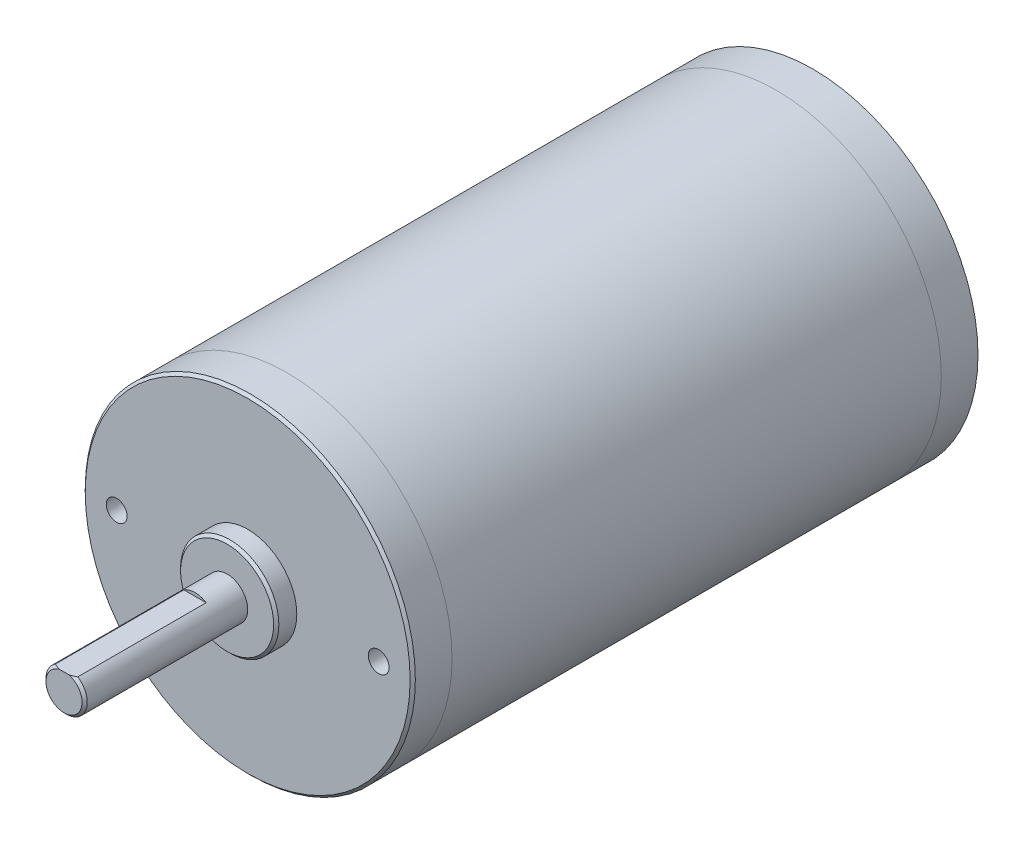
ISO-10303-21;
HEADER;
FILE_DESCRIPTION(('STEP AP214'),'2;1');
FILE_NAME('part.step','',(''),(''),'','','');
FILE_SCHEMA(('AUTOMOTIVE_DESIGN { 1 0 10303 214 1 1 1 1 }'));
ENDSEC;
DATA;
#1=APPLICATION_CONTEXT('core data for automotive mechanical design processes');
#2=APPLICATION_PROTOCOL_DEFINITION('international standard','automotive_design',2000,#1);
#3=PRODUCT_CONTEXT('',#1,'mechanical');
#4=PRODUCT('Part','Part','',(#3));
#5=PRODUCT_RELATED_PRODUCT_CATEGORY('part','',(#4));
#6=PRODUCT_DEFINITION_FORMATION('','',#4);
#7=PRODUCT_DEFINITION_CONTEXT('part definition',#1,'design');
#8=PRODUCT_DEFINITION('design','',#6,#7);
#9=PRODUCT_DEFINITION_SHAPE('','',#8);
#10=(LENGTH_UNIT() NAMED_UNIT(*) SI_UNIT(.MILLI.,.METRE.));
#11=(NAMED_UNIT(*) PLANE_ANGLE_UNIT() SI_UNIT($,.RADIAN.));
#12=(NAMED_UNIT(*) SI_UNIT($,.STERADIAN.) SOLID_ANGLE_UNIT());
#13=UNCERTAINTY_MEASURE_WITH_UNIT(LENGTH_MEASURE(1.E-05),#10,'distance_accuracy_value','');
#14=(GEOMETRIC_REPRESENTATION_CONTEXT(3) GLOBAL_UNCERTAINTY_ASSIGNED_CONTEXT((#13)) GLOBAL_UNIT_ASSIGNED_CONTEXT((#10,
#11,#12)) REPRESENTATION_CONTEXT('',''));
#15=CARTESIAN_POINT('',(0.,0.,0.));
#16=DIRECTION('',(0.,0.,1.));
#17=DIRECTION('',(1.,0.,0.));
#18=AXIS2_PLACEMENT_3D('',#15,#16,#17);
#19=CARTESIAN_POINT('',(0.,0.,141.8336));
#20=DIRECTION('',(0.,0.,-1.));
#21=DIRECTION('',(-1.,0.,0.));
#22=AXIS2_PLACEMENT_3D('',#19,#20,#21);
#23=CYLINDRICAL_SURFACE('',#22,4.0005);
#24=CARTESIAN_POINT('',(0.,0.,110.2106));
#25=DIRECTION('',(0.,0.,1.));
#26=DIRECTION('',(1.,0.,0.));
#27=AXIS2_PLACEMENT_3D('',#24,#25,#26);
#28=CIRCLE('',#27,4.0005);
#29=CARTESIAN_POINT('',(4.0005,0.,110.2106));
#30=VERTEX_POINT('',#29);
#31=EDGE_CURVE('E181',#30,#30,#28,.T.);
#32=ORIENTED_EDGE('',*,*,#31,.T.);
#33=EDGE_LOOP('',(#32));
#34=FACE_BOUND('',#33,.T.);
#35=DIRECTION('',(0.,0.,-1.));
#36=VECTOR('',#35,1.);
#37=CARTESIAN_POINT('',(2.16273206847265,3.3655,141.8336));
#38=LINE('',#37,#36);
#39=CARTESIAN_POINT('',(2.16273206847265,3.3655,141.3256));
#40=VERTEX_POINT('',#39);
#41=CARTESIAN_POINT('',(2.16273206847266,3.3655,116.4336));
#42=VERTEX_POINT('',#41);
#43=EDGE_CURVE('E167',#40,#42,#38,.T.);
#44=ORIENTED_EDGE('',*,*,#43,.F.);
#45=CARTESIAN_POINT('',(0.,0.,141.3256));
#46=DIRECTION('',(0.,0.,1.));
#47=DIRECTION('',(1.,0.,0.));
#48=AXIS2_PLACEMENT_3D('',#45,#46,#47);
#49=CIRCLE('',#48,4.0005);
#50=CARTESIAN_POINT('',(-2.16273206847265,3.3655,141.3256));
#51=VERTEX_POINT('',#50);
#52=EDGE_CURVE('E87',#40,#51,#49,.F.);
#53=ORIENTED_EDGE('',*,*,#52,.T.);
#54=DIRECTION('',(0.,0.,-1.));
#55=VECTOR('',#54,1.);
#56=CARTESIAN_POINT('',(-2.16273206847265,3.3655,141.8336));
#57=LINE('',#56,#55);
#58=CARTESIAN_POINT('',(-2.16273206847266,3.3655,116.4336));
#59=VERTEX_POINT('',#58);
#60=EDGE_CURVE('E171',#59,#51,#57,.F.);
#61=ORIENTED_EDGE('',*,*,#60,.F.);
#62=CARTESIAN_POINT('',(0.,0.,116.4336));
#63=DIRECTION('',(0.,0.,-1.));
#64=DIRECTION('',(-1.,0.,0.));
#65=AXIS2_PLACEMENT_3D('',#62,#63,#64);
#66=CIRCLE('',#65,4.0005);
#67=EDGE_CURVE('E177',#42,#59,#66,.F.);
#68=ORIENTED_EDGE('',*,*,#67,.F.);
#69=EDGE_LOOP('',(#44,#53,#61,#68));
#70=FACE_BOUND('',#69,.T.);
#71=CARTESIAN_POINT('',(-0.990599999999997,-3.87591432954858,113.3348));
#72=CARTESIAN_POINT('',(-0.990600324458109,-3.87591250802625,113.307388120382));
#73=CARTESIAN_POINT('',(-0.989461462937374,-3.8762054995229,113.27998981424));
#74=CARTESIAN_POINT('',(-0.984921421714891,-3.87736227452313,113.225397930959));
#75=CARTESIAN_POINT('',(-0.981520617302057,-3.87822596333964,113.198204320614));
#76=CARTESIAN_POINT('',(-0.967974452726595,-3.88163852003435,113.117336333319));
#77=CARTESIAN_POINT('',(-0.954485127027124,-3.88500908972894,113.064217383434));
#78=CARTESIAN_POINT('',(-0.919024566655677,-3.89354877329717,112.961088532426));
#79=CARTESIAN_POINT('',(-0.89705403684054,-3.89871773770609,112.911078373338));
#80=CARTESIAN_POINT('',(-0.845280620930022,-3.9102688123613,112.81542917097));
#81=CARTESIAN_POINT('',(-0.815475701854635,-3.91665123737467,112.769791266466));
#82=CARTESIAN_POINT('',(-0.748200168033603,-3.93006266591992,112.683226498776));
#83=CARTESIAN_POINT('',(-0.710592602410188,-3.93710177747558,112.64240766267));
#84=CARTESIAN_POINT('',(-0.629070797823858,-3.95094633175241,112.567584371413));
#85=CARTESIAN_POINT('',(-0.585155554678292,-3.95775173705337,112.533581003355));
#86=CARTESIAN_POINT('',(-0.491523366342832,-3.97047403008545,112.47291452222));
#87=CARTESIAN_POINT('',(-0.441735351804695,-3.97637750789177,112.446358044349));
#88=CARTESIAN_POINT('',(-0.338233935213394,-3.98651448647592,112.402033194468));
#89=CARTESIAN_POINT('',(-0.284521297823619,-3.99074831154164,112.384263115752));
#90=CARTESIAN_POINT('',(-0.175826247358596,-3.99699745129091,112.358361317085));
#91=CARTESIAN_POINT('',(-0.120890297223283,-3.9990551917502,112.350045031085));
#92=CARTESIAN_POINT('',(-0.010365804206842,-4.00086811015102,112.342707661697));
#93=CARTESIAN_POINT('',(0.0452226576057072,-4.00062357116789,112.343685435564));
#94=CARTESIAN_POINT('',(0.15419224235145,-3.99789104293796,112.354775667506));
#95=CARTESIAN_POINT('',(0.207595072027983,-3.99545202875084,112.364688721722));
#96=CARTESIAN_POINT('',(0.311953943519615,-3.98866156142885,112.393047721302));
#97=CARTESIAN_POINT('',(0.362909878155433,-3.98431002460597,112.411494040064));
#98=CARTESIAN_POINT('',(0.461457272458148,-3.97410816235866,112.456558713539));
#99=CARTESIAN_POINT('',(0.509014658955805,-3.96824481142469,112.483248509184));
#100=CARTESIAN_POINT('',(0.599044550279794,-3.9556561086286,112.543987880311));
#101=CARTESIAN_POINT('',(0.641516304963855,-3.94893062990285,112.578038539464));
#102=CARTESIAN_POINT('',(0.721355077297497,-3.93514089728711,112.653598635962));
#103=CARTESIAN_POINT('',(0.758557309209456,-3.9280723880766,112.695281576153));
#104=CARTESIAN_POINT('',(0.825488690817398,-3.91455467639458,112.784380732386));
#105=CARTESIAN_POINT('',(0.855215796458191,-3.9081056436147,112.831798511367));
#106=CARTESIAN_POINT('',(0.906458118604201,-3.89654079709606,112.93134765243));
#107=CARTESIAN_POINT('',(0.927929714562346,-3.89143210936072,112.983502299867));
#108=CARTESIAN_POINT('',(0.961721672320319,-3.88322020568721,113.090806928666));
#109=CARTESIAN_POINT('',(0.974055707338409,-3.88011399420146,113.145952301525));
#110=CARTESIAN_POINT('',(0.984612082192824,-3.87744060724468,113.223777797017));
#111=CARTESIAN_POINT('',(0.986857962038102,-3.8768691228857,113.245937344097));
#112=CARTESIAN_POINT('',(0.989850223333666,-3.87610616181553,113.290327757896));
#113=CARTESIAN_POINT('',(0.990599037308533,-3.87591406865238,113.312558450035));
#114=CARTESIAN_POINT('',(0.990599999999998,-3.87591432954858,113.3348));
#115=B_SPLINE_CURVE_WITH_KNOTS('',3,(#71,#72,#73,#74,#75,#76,#77,#78,#79,#80,#81,#82,#83,#84,
#85,#86,#87,#88,#89,#90,#91,#92,#93,#94,#95,#96,#97,#98,#99,#100,#101,#102,#103,#104,#105,#106,
#107,#108,#109,#110,#111,#112,#113,#114),.UNSPECIFIED.,.F.,.F.,(4,2,2,2,2,2,2,2,2,2,2,2,2,2,2,2,
2,2,2,2,2,4),(0.,0.0821837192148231,0.164353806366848,0.328227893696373,0.492088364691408,
0.655991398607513,0.823060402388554,0.990156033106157,1.1595346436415,1.32888034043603,
1.49485985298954,1.66081895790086,1.82316371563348,1.98551557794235,2.14931591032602,
2.31314037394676,2.48129915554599,2.64950386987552,2.81858551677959,2.98741364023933,
3.05421190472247,3.12090154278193),.UNSPECIFIED.);
#116=CARTESIAN_POINT('',(-0.990599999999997,-3.87591432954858,113.3348));
#117=VERTEX_POINT('',#116);
#118=CARTESIAN_POINT('',(0.990599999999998,-3.87591432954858,113.3348));
#119=VERTEX_POINT('',#118);
#120=EDGE_CURVE('E241',#117,#119,#115,.T.);
#121=ORIENTED_EDGE('',*,*,#120,.F.);
#122=DIRECTION('',(0.,0.,-1.));
#123=VECTOR('',#122,1.);
#124=CARTESIAN_POINT('',(-0.990600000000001,-3.87591432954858,141.8336));
#125=LINE('',#124,#123);
#126=CARTESIAN_POINT('',(-0.990599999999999,-3.87591432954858,132.842));
#127=VERTEX_POINT('',#126);
#128=EDGE_CURVE('E15',#127,#117,#125,.T.);
#129=ORIENTED_EDGE('',*,*,#128,.F.);
#130=CARTESIAN_POINT('',(-0.990599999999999,-3.87591432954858,132.842));
#131=CARTESIAN_POINT('',(-0.990600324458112,-3.87591250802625,132.869411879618));
#132=CARTESIAN_POINT('',(-0.989461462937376,-3.8762054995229,132.89681018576));
#133=CARTESIAN_POINT('',(-0.984921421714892,-3.87736227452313,132.951402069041));
#134=CARTESIAN_POINT('',(-0.981520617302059,-3.87822596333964,132.978595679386));
#135=CARTESIAN_POINT('',(-0.967974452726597,-3.88163852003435,133.059463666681));
#136=CARTESIAN_POINT('',(-0.954485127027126,-3.88500908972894,133.112582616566));
#137=CARTESIAN_POINT('',(-0.919024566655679,-3.89354877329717,133.215711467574));
#138=CARTESIAN_POINT('',(-0.897054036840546,-3.89871773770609,133.265721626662));
#139=CARTESIAN_POINT('',(-0.845280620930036,-3.9102688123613,133.36137082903));
#140=CARTESIAN_POINT('',(-0.81547570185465,-3.91665123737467,133.407008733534));
#141=CARTESIAN_POINT('',(-0.748200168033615,-3.93006266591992,133.493573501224));
#142=CARTESIAN_POINT('',(-0.710592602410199,-3.93710177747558,133.53439233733));
#143=CARTESIAN_POINT('',(-0.629070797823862,-3.95094633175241,133.609215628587));
#144=CARTESIAN_POINT('',(-0.58515555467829,-3.95775173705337,133.643218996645));
#145=CARTESIAN_POINT('',(-0.491523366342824,-3.97047403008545,133.70388547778));
#146=CARTESIAN_POINT('',(-0.441735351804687,-3.97637750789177,133.730441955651));
#147=CARTESIAN_POINT('',(-0.338233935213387,-3.98651448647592,133.774766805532));
#148=CARTESIAN_POINT('',(-0.284521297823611,-3.99074831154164,133.792536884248));
#149=CARTESIAN_POINT('',(-0.175826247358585,-3.99699745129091,133.818438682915));
#150=CARTESIAN_POINT('',(-0.12089029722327,-3.9990551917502,133.826754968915));
#151=CARTESIAN_POINT('',(-0.0103658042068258,-4.00086811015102,133.834092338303));
#152=CARTESIAN_POINT('',(0.0452226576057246,-4.00062357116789,133.833114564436));
#153=CARTESIAN_POINT('',(0.154192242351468,-3.99789104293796,133.822024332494));
#154=CARTESIAN_POINT('',(0.207595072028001,-3.99545202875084,133.812111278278));
#155=CARTESIAN_POINT('',(0.311953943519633,-3.98866156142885,133.783752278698));
#156=CARTESIAN_POINT('',(0.36290987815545,-3.98431002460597,133.765305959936));
#157=CARTESIAN_POINT('',(0.461457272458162,-3.97410816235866,133.720241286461));
#158=CARTESIAN_POINT('',(0.509014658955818,-3.96824481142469,133.693551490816));
#159=CARTESIAN_POINT('',(0.599044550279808,-3.9556561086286,133.632812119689));
#160=CARTESIAN_POINT('',(0.641516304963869,-3.94893062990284,133.598761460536));
#161=CARTESIAN_POINT('',(0.721355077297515,-3.93514089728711,133.523201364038));
#162=CARTESIAN_POINT('',(0.758557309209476,-3.9280723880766,133.481518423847));
#163=CARTESIAN_POINT('',(0.825488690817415,-3.91455467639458,133.392419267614));
#164=CARTESIAN_POINT('',(0.855215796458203,-3.9081056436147,133.345001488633));
#165=CARTESIAN_POINT('',(0.906458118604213,-3.89654079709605,133.24545234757));
#166=CARTESIAN_POINT('',(0.927929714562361,-3.89143210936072,133.193297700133));
#167=CARTESIAN_POINT('',(0.96172167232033,-3.88322020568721,133.085993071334));
#168=CARTESIAN_POINT('',(0.974055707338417,-3.88011399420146,133.030847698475));
#169=CARTESIAN_POINT('',(0.984612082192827,-3.87744060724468,132.953022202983));
#170=CARTESIAN_POINT('',(0.986857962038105,-3.8768691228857,132.930862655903));
#171=CARTESIAN_POINT('',(0.989850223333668,-3.87610616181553,132.886472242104));
#172=CARTESIAN_POINT('',(0.990599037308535,-3.87591406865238,132.864241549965));
#173=CARTESIAN_POINT('',(0.9906,-3.87591432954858,132.842));
#174=B_SPLINE_CURVE_WITH_KNOTS('',3,(#130,#131,#132,#133,#134,#135,#136,#137,#138,#139,#140,
#141,#142,#143,#144,#145,#146,#147,#148,#149,#150,#151,#152,#153,#154,#155,#156,#157,#158,#159,
#160,#161,#162,#163,#164,#165,#166,#167,#168,#169,#170,#171,#172,#173),.UNSPECIFIED.,.F.,.F.,(4,
2,2,2,2,2,2,2,2,2,2,2,2,2,2,2,2,2,2,2,2,4),(0.,0.082183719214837,0.164353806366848,
0.328227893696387,0.492088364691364,0.655991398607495,0.823060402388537,0.990156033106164,
1.1595346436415,1.32888034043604,1.49485985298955,1.66081895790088,1.8231637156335,
1.98551557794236,2.14931591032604,2.31314037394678,2.48129915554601,2.64950386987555,
2.81858551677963,2.98741364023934,3.05421190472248,3.12090154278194),.UNSPECIFIED.);
#175=CARTESIAN_POINT('',(0.9906,-3.87591432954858,132.842));
#176=VERTEX_POINT('',#175);
#177=EDGE_CURVE('E72',#127,#176,#174,.T.);
#178=ORIENTED_EDGE('',*,*,#177,.T.);
#179=DIRECTION('',(0.,0.,-1.));
#180=VECTOR('',#179,1.);
#181=CARTESIAN_POINT('',(0.990600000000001,-3.87591432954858,141.8336));
#182=LINE('',#181,#180);
#183=EDGE_CURVE('E253',#176,#119,#182,.T.);
#184=ORIENTED_EDGE('',*,*,#183,.T.);
#185=EDGE_LOOP('',(#121,#129,#178,#184));
#186=FACE_BOUND('',#185,.T.);
#187=ADVANCED_FACE('F62',(#34,#70,#186),#23,.T.);
#188=CARTESIAN_POINT('',(0.,0.,106.2228));
#189=DIRECTION('',(0.,0.,-1.));
#190=DIRECTION('',(-1.,0.,0.));
#191=AXIS2_PLACEMENT_3D('',#188,#189,#190);
#192=CYLINDRICAL_SURFACE('',#191,32.004);
#193=CARTESIAN_POINT('',(0.,0.,105.7148));
#194=DIRECTION('',(0.,0.,1.));
#195=DIRECTION('',(1.,0.,0.));
#196=AXIS2_PLACEMENT_3D('',#193,#194,#195);
#197=CIRCLE('',#196,32.004);
#198=CARTESIAN_POINT('',(-32.004,0.,105.7148));
#199=VERTEX_POINT('',#198);
#200=EDGE_CURVE('E193',#199,#199,#197,.F.);
#201=CARTESIAN_POINT('',(0.,0.,98.6028));
#202=DIRECTION('',(0.,0.,1.));
#203=DIRECTION('',(1.,0.,0.));
#204=AXIS2_PLACEMENT_3D('',#201,#202,#203);
#205=CIRCLE('',#204,32.004);
#206=CARTESIAN_POINT('',(-32.004,0.,98.6028));
#207=VERTEX_POINT('',#206);
#208=EDGE_CURVE('E187',#207,#207,#205,.T.);
#209=CARTESIAN_POINT('',(-32.004,0.,105.7148));
#210=CARTESIAN_POINT('',(-32.004,0.,105.640716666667));
#211=CARTESIAN_POINT('',(-32.004,0.,105.566633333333));
#212=CARTESIAN_POINT('',(-32.004,0.,105.418466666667));
#213=CARTESIAN_POINT('',(-32.004,0.,105.344383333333));
#214=CARTESIAN_POINT('',(-32.004,0.,105.196216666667));
#215=CARTESIAN_POINT('',(-32.004,0.,105.122133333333));
#216=CARTESIAN_POINT('',(-32.004,0.,104.973966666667));
#217=CARTESIAN_POINT('',(-32.004,0.,104.899883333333));
#218=CARTESIAN_POINT('',(-32.004,0.,104.751716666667));
#219=CARTESIAN_POINT('',(-32.004,0.,104.677633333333));
#220=CARTESIAN_POINT('',(-32.004,0.,104.529466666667));
#221=CARTESIAN_POINT('',(-32.004,0.,104.455383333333));
#222=CARTESIAN_POINT('',(-32.004,0.,104.307216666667));
#223=CARTESIAN_POINT('',(-32.004,0.,104.233133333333));
#224=CARTESIAN_POINT('',(-32.004,0.,104.084966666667));
#225=CARTESIAN_POINT('',(-32.004,0.,104.010883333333));
#226=CARTESIAN_POINT('',(-32.004,0.,103.862716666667));
#227=CARTESIAN_POINT('',(-32.004,0.,103.788633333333));
#228=CARTESIAN_POINT('',(-32.004,0.,103.640466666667));
#229=CARTESIAN_POINT('',(-32.004,0.,103.566383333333));
#230=CARTESIAN_POINT('',(-32.004,0.,103.418216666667));
#231=CARTESIAN_POINT('',(-32.004,0.,103.344133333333));
#232=CARTESIAN_POINT('',(-32.004,0.,103.195966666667));
#233=CARTESIAN_POINT('',(-32.004,0.,103.121883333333));
#234=CARTESIAN_POINT('',(-32.004,0.,102.973716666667));
#235=CARTESIAN_POINT('',(-32.004,0.,102.899633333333));
#236=CARTESIAN_POINT('',(-32.004,0.,102.751466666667));
#237=CARTESIAN_POINT('',(-32.004,0.,102.677383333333));
#238=CARTESIAN_POINT('',(-32.004,0.,102.529216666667));
#239=CARTESIAN_POINT('',(-32.004,0.,102.455133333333));
#240=CARTESIAN_POINT('',(-32.004,0.,102.306966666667));
#241=CARTESIAN_POINT('',(-32.004,0.,102.232883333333));
#242=CARTESIAN_POINT('',(-32.004,0.,102.084716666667));
#243=CARTESIAN_POINT('',(-32.004,0.,102.010633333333));
#244=CARTESIAN_POINT('',(-32.004,0.,101.862466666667));
#245=CARTESIAN_POINT('',(-32.004,0.,101.788383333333));
#246=CARTESIAN_POINT('',(-32.004,0.,101.640216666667));
#247=CARTESIAN_POINT('',(-32.004,0.,101.566133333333));
#248=CARTESIAN_POINT('',(-32.004,0.,101.417966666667));
#249=CARTESIAN_POINT('',(-32.004,0.,101.343883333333));
#250=CARTESIAN_POINT('',(-32.004,0.,101.195716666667));
#251=CARTESIAN_POINT('',(-32.004,0.,101.121633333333));
#252=CARTESIAN_POINT('',(-32.004,0.,100.973466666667));
#253=CARTESIAN_POINT('',(-32.004,0.,100.899383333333));
#254=CARTESIAN_POINT('',(-32.004,0.,100.751216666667));
#255=CARTESIAN_POINT('',(-32.004,0.,100.677133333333));
#256=CARTESIAN_POINT('',(-32.004,0.,100.528966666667));
#257=CARTESIAN_POINT('',(-32.004,0.,100.454883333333));
#258=CARTESIAN_POINT('',(-32.004,0.,100.306716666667));
#259=CARTESIAN_POINT('',(-32.004,0.,100.232633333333));
#260=CARTESIAN_POINT('',(-32.004,0.,100.084466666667));
#261=CARTESIAN_POINT('',(-32.004,0.,100.010383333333));
#262=CARTESIAN_POINT('',(-32.004,0.,99.8622166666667));
#263=CARTESIAN_POINT('',(-32.004,0.,99.7881333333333));
#264=CARTESIAN_POINT('',(-32.004,0.,99.6399666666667));
#265=CARTESIAN_POINT('',(-32.004,0.,99.5658833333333));
#266=CARTESIAN_POINT('',(-32.004,0.,99.4177166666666));
#267=CARTESIAN_POINT('',(-32.004,0.,99.3436333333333));
#268=CARTESIAN_POINT('',(-32.004,0.,99.1954666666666));
#269=CARTESIAN_POINT('',(-32.004,0.,99.1213833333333));
#270=CARTESIAN_POINT('',(-32.004,0.,98.9732166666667));
#271=CARTESIAN_POINT('',(-32.004,0.,98.8991333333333));
#272=CARTESIAN_POINT('',(-32.004,0.,98.7509666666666));
#273=CARTESIAN_POINT('',(-32.004,0.,98.6768833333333));
#274=CARTESIAN_POINT('',(-32.004,0.,98.6028));
#275=B_SPLINE_CURVE_WITH_KNOTS('',3,(#209,#210,#211,#212,#213,#214,#215,#216,#217,#218,#219,
#220,#221,#222,#223,#224,#225,#226,#227,#228,#229,#230,#231,#232,#233,#234,#235,#236,#237,#238,
#239,#240,#241,#242,#243,#244,#245,#246,#247,#248,#249,#250,#251,#252,#253,#254,#255,#256,#257,
#258,#259,#260,#261,#262,#263,#264,#265,#266,#267,#268,#269,#270,#271,#272,#273,#274),
.UNSPECIFIED.,.F.,.F.,(4,2,2,2,2,2,2,2,2,2,2,2,2,2,2,2,2,2,2,2,2,2,2,2,2,2,2,2,2,2,2,2,4),(0.,
0.222249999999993,0.4445,0.666749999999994,0.889000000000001,1.11124999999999,1.3335,
1.55574999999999,1.778,2.00025000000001,2.2225,2.44475000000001,2.667,2.88925000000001,3.1115,
3.33375000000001,3.55600000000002,3.77825000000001,4.00050000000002,4.22275000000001,
4.44500000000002,4.66725000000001,4.88950000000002,5.11175000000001,5.33400000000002,
5.55625000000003,5.77850000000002,6.00075000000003,6.22300000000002,6.44525000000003,
6.66750000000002,6.88975000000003,7.11200000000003),.UNSPECIFIED.);
#276=EDGE_CURVE('BSEAM236',#199,#207,#275,.T.);
#277=ORIENTED_EDGE('',*,*,#200,.T.);
#278=ORIENTED_EDGE('',*,*,#208,.T.);
#279=ORIENTED_EDGE('',*,*,#276,.T.);
#280=ORIENTED_EDGE('',*,*,#276,.F.);
#281=EDGE_LOOP('',(#277,#279,#278,#280));
#282=FACE_BOUND('',#281,.T.);
#283=ADVANCED_FACE('F236',(#282),#192,.T.);
#284=CARTESIAN_POINT('',(0.,0.,106.2228));
#285=DIRECTION('',(0.,0.,1.));
#286=DIRECTION('',(1.,0.,0.));
#287=AXIS2_PLACEMENT_3D('',#284,#285,#286);
#288=PLANE('',#287);
#289=CARTESIAN_POINT('',(25.4,0.,106.2228));
#290=DIRECTION('',(0.,0.,1.));
#291=DIRECTION('',(1.,0.,0.));
#292=AXIS2_PLACEMENT_3D('',#289,#290,#291);
#293=CIRCLE('',#292,2.0193);
#294=CARTESIAN_POINT('',(27.4193,0.,106.2228));
#295=VERTEX_POINT('',#294);
#296=EDGE_CURVE('E473',#295,#295,#293,.T.);
#297=ORIENTED_EDGE('',*,*,#296,.F.);
#298=EDGE_LOOP('',(#297));
#299=FACE_BOUND('',#298,.T.);
#300=CARTESIAN_POINT('',(-25.4,0.,106.2228));
#301=DIRECTION('',(0.,0.,1.));
#302=DIRECTION('',(1.,0.,0.));
#303=AXIS2_PLACEMENT_3D('',#300,#301,#302);
#304=CIRCLE('',#303,2.0193);
#305=CARTESIAN_POINT('',(-23.3807,0.,106.2228));
#306=VERTEX_POINT('',#305);
#307=EDGE_CURVE('E152',#306,#306,#304,.T.);
#308=ORIENTED_EDGE('',*,*,#307,.F.);
#309=EDGE_LOOP('',(#308));
#310=FACE_BOUND('',#309,.T.);
#311=CARTESIAN_POINT('',(0.,0.,106.2228));
#312=DIRECTION('',(0.,0.,1.));
#313=DIRECTION('',(1.,0.,0.));
#314=AXIS2_PLACEMENT_3D('',#311,#312,#313);
#315=CIRCLE('',#314,31.496);
#316=CARTESIAN_POINT('',(31.496,0.,106.2228));
#317=VERTEX_POINT('',#316);
#318=EDGE_CURVE('E190',#317,#317,#315,.T.);
#319=ORIENTED_EDGE('',*,*,#318,.T.);
#320=EDGE_LOOP('',(#319));
#321=FACE_BOUND('',#320,.T.);
#322=CARTESIAN_POINT('',(0.,0.,106.2228));
#323=DIRECTION('',(0.,0.,1.));
#324=DIRECTION('',(1.,0.,0.));
#325=AXIS2_PLACEMENT_3D('',#322,#323,#324);
#326=CIRCLE('',#325,9.525);
#327=CARTESIAN_POINT('',(9.525,0.,106.2228));
#328=VERTEX_POINT('',#327);
#329=EDGE_CURVE('E184',#328,#328,#326,.T.);
#330=ORIENTED_EDGE('',*,*,#329,.F.);
#331=EDGE_LOOP('',(#330));
#332=FACE_BOUND('',#331,.T.);
#333=ADVANCED_FACE('F288',(#299,#310,#321,#332),#288,.T.);
#334=CARTESIAN_POINT('',(0.,0.,98.6028));
#335=DIRECTION('',(0.,0.,1.));
#336=DIRECTION('',(1.,0.,0.));
#337=AXIS2_PLACEMENT_3D('',#334,#335,#336);
#338=PLANE('',#337);
#339=CARTESIAN_POINT('',(0.,0.,98.6028));
#340=DIRECTION('',(0.,0.,1.));
#341=DIRECTION('',(1.,0.,0.));
#342=AXIS2_PLACEMENT_3D('',#339,#340,#341);
#343=CIRCLE('',#342,30.4673);
#344=CARTESIAN_POINT('',(30.4673,0.,98.6028));
#345=VERTEX_POINT('',#344);
#346=EDGE_CURVE('E159',#345,#345,#343,.T.);
#347=ORIENTED_EDGE('',*,*,#346,.T.);
#348=EDGE_LOOP('',(#347));
#349=FACE_BOUND('',#348,.T.);
#350=ORIENTED_EDGE('',*,*,#208,.F.);
#351=EDGE_LOOP('',(#350));
#352=FACE_BOUND('',#351,.T.);
#353=ADVANCED_FACE('F284',(#349,#352),#338,.F.);
#354=CARTESIAN_POINT('',(0.,0.,110.2106));
#355=DIRECTION('',(0.,0.,-1.));
#356=DIRECTION('',(-1.,0.,0.));
#357=AXIS2_PLACEMENT_3D('',#354,#355,#356);
#358=CYLINDRICAL_SURFACE('',#357,9.525);
#359=CARTESIAN_POINT('',(0.,0.,109.7026));
#360=DIRECTION('',(0.,0.,1.));
#361=DIRECTION('',(1.,0.,0.));
#362=AXIS2_PLACEMENT_3D('',#359,#360,#361);
#363=CIRCLE('',#362,9.525);
#364=CARTESIAN_POINT('',(9.525,0.,109.7026));
#365=VERTEX_POINT('',#364);
#366=EDGE_CURVE('E199',#365,#365,#363,.F.);
#367=ORIENTED_EDGE('',*,*,#366,.T.);
#368=EDGE_LOOP('',(#367));
#369=FACE_BOUND('',#368,.T.);
#370=ORIENTED_EDGE('',*,*,#329,.T.);
#371=EDGE_LOOP('',(#370));
#372=FACE_BOUND('',#371,.T.);
#373=ADVANCED_FACE('F287',(#369,#372),#358,.T.);
#374=CARTESIAN_POINT('',(0.,0.,110.2106));
#375=DIRECTION('',(0.,0.,1.));
#376=DIRECTION('',(1.,0.,0.));
#377=AXIS2_PLACEMENT_3D('',#374,#375,#376);
#378=PLANE('',#377);
#379=CARTESIAN_POINT('',(0.,0.,110.2106));
#380=DIRECTION('',(0.,0.,1.));
#381=DIRECTION('',(1.,0.,0.));
#382=AXIS2_PLACEMENT_3D('',#379,#380,#381);
#383=CIRCLE('',#382,9.01700000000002);
#384=CARTESIAN_POINT('',(9.01700000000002,0.,110.2106));
#385=VERTEX_POINT('',#384);
#386=EDGE_CURVE('E196',#385,#385,#383,.T.);
#387=ORIENTED_EDGE('',*,*,#386,.T.);
#388=EDGE_LOOP('',(#387));
#389=FACE_BOUND('',#388,.T.);
#390=ORIENTED_EDGE('',*,*,#31,.F.);
#391=EDGE_LOOP('',(#390));
#392=FACE_BOUND('',#391,.T.);
#393=ADVANCED_FACE('F231',(#389,#392),#378,.T.);
#394=CARTESIAN_POINT('',(0.,0.,141.8336));
#395=DIRECTION('',(0.,0.,1.));
#396=DIRECTION('',(1.,0.,0.));
#397=AXIS2_PLACEMENT_3D('',#394,#395,#396);
#398=PLANE('',#397);
#399=DIRECTION('',(-1.,0.,0.));
#400=VECTOR('',#399,1.);
#401=CARTESIAN_POINT('',(32.005,3.3655,141.8336));
#402=LINE('',#401,#400);
#403=CARTESIAN_POINT('',(0.933255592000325,3.3655,141.8336));
#404=VERTEX_POINT('',#403);
#405=CARTESIAN_POINT('',(-0.933255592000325,3.3655,141.8336));
#406=VERTEX_POINT('',#405);
#407=EDGE_CURVE('E174',#404,#406,#402,.T.);
#408=ORIENTED_EDGE('',*,*,#407,.T.);
#409=CARTESIAN_POINT('',(0.,0.,141.8336));
#410=DIRECTION('',(0.,0.,1.));
#411=DIRECTION('',(1.,0.,0.));
#412=AXIS2_PLACEMENT_3D('',#409,#410,#411);
#413=CIRCLE('',#412,3.49249999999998);
#414=EDGE_CURVE('E202',#406,#404,#413,.T.);
#415=ORIENTED_EDGE('',*,*,#414,.T.);
#416=EDGE_LOOP('',(#408,#415));
#417=FACE_BOUND('',#416,.T.);
#418=ADVANCED_FACE('F221',(#417),#398,.T.);
#419=CARTESIAN_POINT('',(32.005,3.3655,141.8336));
#420=DIRECTION('',(0.,-1.,0.));
#421=DIRECTION('',(0.,0.,-1.));
#422=AXIS2_PLACEMENT_3D('',#419,#420,#421);
#423=PLANE('',#422);
#424=ORIENTED_EDGE('',*,*,#407,.F.);
#425=CARTESIAN_POINT('',(0.933255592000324,3.3655,141.8336));
#426=CARTESIAN_POINT('',(1.04087980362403,3.3655,141.804837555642));
#427=CARTESIAN_POINT('',(1.14726164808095,3.3655,141.771793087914));
#428=CARTESIAN_POINT('',(1.35715872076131,3.3655,141.698590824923));
#429=CARTESIAN_POINT('',(1.46068246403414,3.3655,141.658457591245));
#430=CARTESIAN_POINT('',(1.66513568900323,3.3655,141.572347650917));
#431=CARTESIAN_POINT('',(1.76606708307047,3.3655,141.526375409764));
#432=CARTESIAN_POINT('',(1.96594131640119,3.3655,141.429445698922));
#433=CARTESIAN_POINT('',(2.06487621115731,3.3655,141.37847178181));
#434=CARTESIAN_POINT('',(2.16273206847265,3.3655,141.3256));
#435=B_SPLINE_CURVE_WITH_KNOTS('',3,(#425,#426,#427,#428,#429,#430,#431,#432,#433,#434),
.UNSPECIFIED.,.F.,.F.,(4,2,2,2,4),(0.,0.333979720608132,0.666824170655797,0.999415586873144,
1.33313988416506),.UNSPECIFIED.);
#436=EDGE_CURVE('E80',#404,#40,#435,.T.);
#437=ORIENTED_EDGE('',*,*,#436,.T.);
#438=ORIENTED_EDGE('',*,*,#43,.T.);
#439=DIRECTION('',(-1.,0.,0.));
#440=VECTOR('',#439,1.);
#441=CARTESIAN_POINT('',(32.005,3.3655,116.4336));
#442=LINE('',#441,#440);
#443=EDGE_CURVE('E173',#42,#59,#442,.T.);
#444=ORIENTED_EDGE('',*,*,#443,.T.);
#445=ORIENTED_EDGE('',*,*,#60,.T.);
#446=CARTESIAN_POINT('',(-2.16273206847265,3.3655,141.3256));
#447=CARTESIAN_POINT('',(-2.06487621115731,3.3655,141.37847178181));
#448=CARTESIAN_POINT('',(-1.96594131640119,3.3655,141.429445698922));
#449=CARTESIAN_POINT('',(-1.76606708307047,3.3655,141.526375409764));
#450=CARTESIAN_POINT('',(-1.66513568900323,3.3655,141.572347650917));
#451=CARTESIAN_POINT('',(-1.46068246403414,3.3655,141.658457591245));
#452=CARTESIAN_POINT('',(-1.35715872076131,3.3655,141.698590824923));
#453=CARTESIAN_POINT('',(-1.14726164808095,3.3655,141.771793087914));
#454=CARTESIAN_POINT('',(-1.04087980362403,3.3655,141.804837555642));
#455=CARTESIAN_POINT('',(-0.933255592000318,3.3655,141.8336));
#456=B_SPLINE_CURVE_WITH_KNOTS('',3,(#446,#447,#448,#449,#450,#451,#452,#453,#454,#455),
.UNSPECIFIED.,.F.,.F.,(4,2,2,2,4),(0.,0.333724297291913,0.666315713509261,0.999160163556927,
1.33313988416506),.UNSPECIFIED.);
#457=EDGE_CURVE('E205',#51,#406,#456,.T.);
#458=ORIENTED_EDGE('',*,*,#457,.T.);
#459=EDGE_LOOP('',(#424,#437,#438,#444,#445,#458));
#460=FACE_BOUND('',#459,.T.);
#461=ADVANCED_FACE('F215',(#460),#423,.F.);
#462=CARTESIAN_POINT('',(32.005,3.3655,116.4336));
#463=DIRECTION('',(0.,0.,-1.));
#464=DIRECTION('',(-1.,0.,0.));
#465=AXIS2_PLACEMENT_3D('',#462,#463,#464);
#466=PLANE('',#465);
#467=ORIENTED_EDGE('',*,*,#67,.T.);
#468=ORIENTED_EDGE('',*,*,#443,.F.);
#469=EDGE_LOOP('',(#467,#468));
#470=FACE_BOUND('',#469,.T.);
#471=ADVANCED_FACE('F220',(#470),#466,.F.);
#472=CARTESIAN_POINT('',(0.,0.,106.2228));
#473=DIRECTION('',(0.,0.,-1.));
#474=DIRECTION('',(-1.,0.,0.));
#475=AXIS2_PLACEMENT_3D('',#472,#473,#474);
#476=CONICAL_SURFACE('',#475,31.496,0.785398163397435);
#477=ORIENTED_EDGE('',*,*,#200,.F.);
#478=EDGE_LOOP('',(#477));
#479=FACE_BOUND('',#478,.T.);
#480=ORIENTED_EDGE('',*,*,#318,.F.);
#481=EDGE_LOOP('',(#480));
#482=FACE_BOUND('',#481,.T.);
#483=ADVANCED_FACE('F227',(#479,#482),#476,.T.);
#484=CARTESIAN_POINT('',(0.,0.,110.2106));
#485=DIRECTION('',(0.,0.,-1.));
#486=DIRECTION('',(-1.,0.,0.));
#487=AXIS2_PLACEMENT_3D('',#484,#485,#486);
#488=CONICAL_SURFACE('',#487,9.01700000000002,0.785398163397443);
#489=ORIENTED_EDGE('',*,*,#366,.F.);
#490=EDGE_LOOP('',(#489));
#491=FACE_BOUND('',#490,.T.);
#492=ORIENTED_EDGE('',*,*,#386,.F.);
#493=EDGE_LOOP('',(#492));
#494=FACE_BOUND('',#493,.T.);
#495=ADVANCED_FACE('F302',(#491,#494),#488,.T.);
#496=CARTESIAN_POINT('',(0.,0.,141.8336));
#497=DIRECTION('',(0.,0.,-1.));
#498=DIRECTION('',(-1.,0.,0.));
#499=AXIS2_PLACEMENT_3D('',#496,#497,#498);
#500=CONICAL_SURFACE('',#499,3.49249999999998,0.785398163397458);
#501=ORIENTED_EDGE('',*,*,#457,.F.);
#502=ORIENTED_EDGE('',*,*,#52,.F.);
#503=ORIENTED_EDGE('',*,*,#436,.F.);
#504=ORIENTED_EDGE('',*,*,#414,.F.);
#505=EDGE_LOOP('',(#501,#502,#503,#504));
#506=FACE_BOUND('',#505,.T.);
#507=ADVANCED_FACE('F64',(#506),#500,.T.);
#508=CARTESIAN_POINT('',(0.,0.,96.5454));
#509=DIRECTION('',(0.,0.,1.));
#510=DIRECTION('',(1.,0.,0.));
#511=AXIS2_PLACEMENT_3D('',#508,#509,#510);
#512=CYLINDRICAL_SURFACE('',#511,30.4673);
#513=CARTESIAN_POINT('',(0.,0.,96.5454));
#514=DIRECTION('',(0.,0.,1.));
#515=DIRECTION('',(1.,0.,0.));
#516=AXIS2_PLACEMENT_3D('',#513,#514,#515);
#517=CIRCLE('',#516,30.4673);
#518=CARTESIAN_POINT('',(30.4673,0.,96.5454));
#519=VERTEX_POINT('',#518);
#520=EDGE_CURVE('E164',#519,#519,#517,.T.);
#521=ORIENTED_EDGE('',*,*,#520,.T.);
#522=EDGE_LOOP('',(#521));
#523=FACE_BOUND('',#522,.T.);
#524=ORIENTED_EDGE('',*,*,#346,.F.);
#525=EDGE_LOOP('',(#524));
#526=FACE_BOUND('',#525,.T.);
#527=ADVANCED_FACE('F222',(#523,#526),#512,.T.);
#528=CARTESIAN_POINT('',(0.,0.,96.5454));
#529=DIRECTION('',(0.,0.,1.));
#530=DIRECTION('',(1.,0.,0.));
#531=AXIS2_PLACEMENT_3D('',#528,#529,#530);
#532=PLANE('',#531);
#533=CARTESIAN_POINT('',(25.4,0.,96.5454));
#534=DIRECTION('',(0.,0.,1.));
#535=DIRECTION('',(1.,0.,0.));
#536=AXIS2_PLACEMENT_3D('',#533,#534,#535);
#537=CIRCLE('',#536,2.0193);
#538=CARTESIAN_POINT('',(27.4193,0.,96.5454));
#539=VERTEX_POINT('',#538);
#540=EDGE_CURVE('E67',#539,#539,#537,.T.);
#541=ORIENTED_EDGE('',*,*,#540,.T.);
#542=EDGE_LOOP('',(#541));
#543=FACE_BOUND('',#542,.T.);
#544=CARTESIAN_POINT('',(-25.4,0.,96.5454));
#545=DIRECTION('',(0.,0.,1.));
#546=DIRECTION('',(1.,0.,0.));
#547=AXIS2_PLACEMENT_3D('',#544,#545,#546);
#548=CIRCLE('',#547,2.0193);
#549=CARTESIAN_POINT('',(-23.3807,0.,96.5454));
#550=VERTEX_POINT('',#549);
#551=EDGE_CURVE('E150',#550,#550,#548,.T.);
#552=ORIENTED_EDGE('',*,*,#551,.T.);
#553=EDGE_LOOP('',(#552));
#554=FACE_BOUND('',#553,.T.);
#555=ORIENTED_EDGE('',*,*,#520,.F.);
#556=EDGE_LOOP('',(#555));
#557=FACE_BOUND('',#556,.T.);
#558=ADVANCED_FACE('F268',(#543,#554,#557),#532,.F.);
#559=CARTESIAN_POINT('',(-0.990599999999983,-2.8067,0.));
#560=DIRECTION('',(1.,0.,0.));
#561=DIRECTION('',(0.,0.,-1.));
#562=AXIS2_PLACEMENT_3D('',#559,#560,#561);
#563=PLANE('',#562);
#564=ORIENTED_EDGE('',*,*,#128,.T.);
#565=DIRECTION('',(0.,-1.,0.));
#566=VECTOR('',#565,1.);
#567=CARTESIAN_POINT('',(-0.990599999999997,-2.8067,113.3348));
#568=LINE('',#567,#566);
#569=CARTESIAN_POINT('',(-0.990599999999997,-2.8067,113.3348));
#570=VERTEX_POINT('',#569);
#571=EDGE_CURVE('E128',#570,#117,#568,.T.);
#572=ORIENTED_EDGE('',*,*,#571,.F.);
#573=DIRECTION('',(0.,0.,1.));
#574=VECTOR('',#573,1.);
#575=CARTESIAN_POINT('',(-0.990599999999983,-2.8067,0.));
#576=LINE('',#575,#574);
#577=CARTESIAN_POINT('',(-0.990599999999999,-2.8067,132.842));
#578=VERTEX_POINT('',#577);
#579=EDGE_CURVE('E136',#570,#578,#576,.T.);
#580=ORIENTED_EDGE('',*,*,#579,.T.);
#581=DIRECTION('',(0.,-1.,0.));
#582=VECTOR('',#581,1.);
#583=CARTESIAN_POINT('',(-0.990599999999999,-2.8067,132.842));
#584=LINE('',#583,#582);
#585=EDGE_CURVE('E157',#578,#127,#584,.T.);
#586=ORIENTED_EDGE('',*,*,#585,.T.);
#587=EDGE_LOOP('',(#564,#572,#580,#586));
#588=FACE_BOUND('',#587,.T.);
#589=ADVANCED_FACE('F139',(#588),#563,.T.);
#590=CARTESIAN_POINT('',(0.,-2.8067,132.842));
#591=DIRECTION('',(0.,-1.,0.));
#592=DIRECTION('',(0.,0.,-1.));
#593=AXIS2_PLACEMENT_3D('',#590,#591,#592);
#594=CYLINDRICAL_SURFACE('',#593,0.9906);
#595=ORIENTED_EDGE('',*,*,#585,.F.);
#596=CARTESIAN_POINT('',(0.,-2.8067,132.842));
#597=DIRECTION('',(0.,-1.,0.));
#598=DIRECTION('',(0.,0.,-1.));
#599=AXIS2_PLACEMENT_3D('',#596,#597,#598);
#600=CIRCLE('',#599,0.9906);
#601=CARTESIAN_POINT('',(0.9906,-2.8067,132.842));
#602=VERTEX_POINT('',#601);
#603=EDGE_CURVE('E143',#602,#578,#600,.T.);
#604=ORIENTED_EDGE('',*,*,#603,.F.);
#605=DIRECTION('',(0.,-1.,0.));
#606=VECTOR('',#605,1.);
#607=CARTESIAN_POINT('',(0.9906,-2.8067,132.842));
#608=LINE('',#607,#606);
#609=EDGE_CURVE('E160',#602,#176,#608,.T.);
#610=ORIENTED_EDGE('',*,*,#609,.T.);
#611=ORIENTED_EDGE('',*,*,#177,.F.);
#612=EDGE_LOOP('',(#595,#604,#610,#611));
#613=FACE_BOUND('',#612,.T.);
#614=ADVANCED_FACE('F254',(#613),#594,.F.);
#615=CARTESIAN_POINT('',(0.990599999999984,-2.8067,0.));
#616=DIRECTION('',(1.,0.,0.));
#617=DIRECTION('',(0.,0.,-1.));
#618=AXIS2_PLACEMENT_3D('',#615,#616,#617);
#619=PLANE('',#618);
#620=ORIENTED_EDGE('',*,*,#609,.F.);
#621=DIRECTION('',(0.,0.,1.));
#622=VECTOR('',#621,1.);
#623=CARTESIAN_POINT('',(0.990599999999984,-2.8067,0.));
#624=LINE('',#623,#622);
#625=CARTESIAN_POINT('',(0.990599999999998,-2.8067,113.3348));
#626=VERTEX_POINT('',#625);
#627=EDGE_CURVE('E135',#626,#602,#624,.T.);
#628=ORIENTED_EDGE('',*,*,#627,.F.);
#629=DIRECTION('',(0.,-1.,0.));
#630=VECTOR('',#629,1.);
#631=CARTESIAN_POINT('',(0.990599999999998,-2.8067,113.3348));
#632=LINE('',#631,#630);
#633=EDGE_CURVE('E130',#626,#119,#632,.T.);
#634=ORIENTED_EDGE('',*,*,#633,.T.);
#635=ORIENTED_EDGE('',*,*,#183,.F.);
#636=EDGE_LOOP('',(#620,#628,#634,#635));
#637=FACE_BOUND('',#636,.T.);
#638=ADVANCED_FACE('F259',(#637),#619,.F.);
#639=CARTESIAN_POINT('',(0.,-2.8067,113.3348));
#640=DIRECTION('',(0.,-1.,0.));
#641=DIRECTION('',(0.,0.,-1.));
#642=AXIS2_PLACEMENT_3D('',#639,#640,#641);
#643=CYLINDRICAL_SURFACE('',#642,0.990599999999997);
#644=ORIENTED_EDGE('',*,*,#571,.T.);
#645=ORIENTED_EDGE('',*,*,#120,.T.);
#646=ORIENTED_EDGE('',*,*,#633,.F.);
#647=CARTESIAN_POINT('',(0.,-2.8067,113.3348));
#648=DIRECTION('',(0.,-1.,0.));
#649=DIRECTION('',(0.,0.,-1.));
#650=AXIS2_PLACEMENT_3D('',#647,#648,#649);
#651=CIRCLE('',#650,0.990599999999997);
#652=EDGE_CURVE('E125',#626,#570,#651,.F.);
#653=ORIENTED_EDGE('',*,*,#652,.T.);
#654=EDGE_LOOP('',(#644,#645,#646,#653));
#655=FACE_BOUND('',#654,.T.);
#656=ADVANCED_FACE('F127',(#655),#643,.F.);
#657=CARTESIAN_POINT('',(0.,-2.8067,0.));
#658=DIRECTION('',(0.,-1.,0.));
#659=DIRECTION('',(0.,0.,-1.));
#660=AXIS2_PLACEMENT_3D('',#657,#658,#659);
#661=PLANE('',#660);
#662=ORIENTED_EDGE('',*,*,#579,.F.);
#663=ORIENTED_EDGE('',*,*,#652,.F.);
#664=ORIENTED_EDGE('',*,*,#627,.T.);
#665=ORIENTED_EDGE('',*,*,#603,.T.);
#666=EDGE_LOOP('',(#662,#663,#664,#665));
#667=FACE_BOUND('',#666,.T.);
#668=ADVANCED_FACE('F146',(#667),#661,.T.);
#669=CARTESIAN_POINT('',(-25.4,0.,92.6084));
#670=DIRECTION('',(0.,0.,1.));
#671=DIRECTION('',(1.,0.,0.));
#672=AXIS2_PLACEMENT_3D('',#669,#670,#671);
#673=CYLINDRICAL_SURFACE('',#672,2.0193);
#674=ORIENTED_EDGE('',*,*,#307,.T.);
#675=EDGE_LOOP('',(#674));
#676=FACE_BOUND('',#675,.T.);
#677=ORIENTED_EDGE('',*,*,#551,.F.);
#678=EDGE_LOOP('',(#677));
#679=FACE_BOUND('',#678,.T.);
#680=ADVANCED_FACE('F360',(#676,#679),#673,.F.);
#681=CARTESIAN_POINT('',(25.4,0.,92.6084));
#682=DIRECTION('',(0.,0.,1.));
#683=DIRECTION('',(1.,0.,0.));
#684=AXIS2_PLACEMENT_3D('',#681,#682,#683);
#685=CYLINDRICAL_SURFACE('',#684,2.0193);
#686=ORIENTED_EDGE('',*,*,#296,.T.);
#687=EDGE_LOOP('',(#686));
#688=FACE_BOUND('',#687,.T.);
#689=ORIENTED_EDGE('',*,*,#540,.F.);
#690=EDGE_LOOP('',(#689));
#691=FACE_BOUND('',#690,.T.);
#692=ADVANCED_FACE('F366',(#688,#691),#685,.F.);
#693=CLOSED_SHELL('',(#187,#283,#333,#353,#373,#393,#418,#461,#471,#483,#495,#507,#527,#558,
#589,#614,#638,#656,#668,#680,#692));
#694=MANIFOLD_SOLID_BREP('B2',#693);
#695=CARTESIAN_POINT('',(0.,0.,98.6028));
#696=DIRECTION('',(0.,0.,-1.));
#697=DIRECTION('',(-1.,0.,0.));
#698=AXIS2_PLACEMENT_3D('',#695,#696,#697);
#699=CYLINDRICAL_SURFACE('',#698,32.004);
#700=CARTESIAN_POINT('',(0.,0.,98.6028));
#701=DIRECTION('',(0.,0.,1.));
#702=DIRECTION('',(1.,0.,0.));
#703=AXIS2_PLACEMENT_3D('',#700,#701,#702);
#704=CIRCLE('',#703,32.004);
#705=CARTESIAN_POINT('',(-32.004,0.,98.6028));
#706=VERTEX_POINT('',#705);
#707=EDGE_CURVE('E61',#706,#706,#704,.T.);
#708=CARTESIAN_POINT('',(0.,0.,3.7338));
#709=DIRECTION('',(0.,0.,1.));
#710=DIRECTION('',(1.,0.,0.));
#711=AXIS2_PLACEMENT_3D('',#708,#709,#710);
#712=CIRCLE('',#711,32.004);
#713=CARTESIAN_POINT('',(-32.004,0.,3.7338));
#714=VERTEX_POINT('',#713);
#715=EDGE_CURVE('E512',#714,#714,#712,.T.);
#716=CARTESIAN_POINT('',(-32.004,0.,98.6028));
#717=CARTESIAN_POINT('',(-32.004,0.,97.61458125));
#718=CARTESIAN_POINT('',(-32.004,0.,96.6263625));
#719=CARTESIAN_POINT('',(-32.004,0.,94.649925));
#720=CARTESIAN_POINT('',(-32.004,0.,93.66170625));
#721=CARTESIAN_POINT('',(-32.004,0.,91.68526875));
#722=CARTESIAN_POINT('',(-32.004,0.,90.69705));
#723=CARTESIAN_POINT('',(-32.004,0.,88.7206125));
#724=CARTESIAN_POINT('',(-32.004,0.,87.73239375));
#725=CARTESIAN_POINT('',(-32.004,0.,85.75595625));
#726=CARTESIAN_POINT('',(-32.004,0.,84.7677375));
#727=CARTESIAN_POINT('',(-32.004,0.,82.7913));
#728=CARTESIAN_POINT('',(-32.004,0.,81.80308125));
#729=CARTESIAN_POINT('',(-32.004,0.,79.82664375));
#730=CARTESIAN_POINT('',(-32.004,0.,78.838425));
#731=CARTESIAN_POINT('',(-32.004,0.,76.8619875));
#732=CARTESIAN_POINT('',(-32.004,0.,75.87376875));
#733=CARTESIAN_POINT('',(-32.004,0.,73.89733125));
#734=CARTESIAN_POINT('',(-32.004,0.,72.9091125));
#735=CARTESIAN_POINT('',(-32.004,0.,70.932675));
#736=CARTESIAN_POINT('',(-32.004,0.,69.94445625));
#737=CARTESIAN_POINT('',(-32.004,0.,67.96801875));
#738=CARTESIAN_POINT('',(-32.004,0.,66.9798));
#739=CARTESIAN_POINT('',(-32.004,0.,65.0033625));
#740=CARTESIAN_POINT('',(-32.004,0.,64.01514375));
#741=CARTESIAN_POINT('',(-32.004,0.,62.03870625));
#742=CARTESIAN_POINT('',(-32.004,0.,61.0504875));
#743=CARTESIAN_POINT('',(-32.004,0.,59.07405));
#744=CARTESIAN_POINT('',(-32.004,0.,58.08583125));
#745=CARTESIAN_POINT('',(-32.004,0.,56.10939375));
#746=CARTESIAN_POINT('',(-32.004,0.,55.121175));
#747=CARTESIAN_POINT('',(-32.004,0.,53.1447375));
#748=CARTESIAN_POINT('',(-32.004,0.,52.15651875));
#749=CARTESIAN_POINT('',(-32.004,0.,50.18008125));
#750=CARTESIAN_POINT('',(-32.004,0.,49.1918625));
#751=CARTESIAN_POINT('',(-32.004,0.,47.215425));
#752=CARTESIAN_POINT('',(-32.004,0.,46.22720625));
#753=CARTESIAN_POINT('',(-32.004,0.,44.25076875));
#754=CARTESIAN_POINT('',(-32.004,0.,43.26255));
#755=CARTESIAN_POINT('',(-32.004,0.,41.2861125));
#756=CARTESIAN_POINT('',(-32.004,0.,40.29789375));
#757=CARTESIAN_POINT('',(-32.004,0.,38.32145625));
#758=CARTESIAN_POINT('',(-32.004,0.,37.3332375));
#759=CARTESIAN_POINT('',(-32.004,0.,35.3568));
#760=CARTESIAN_POINT('',(-32.004,0.,34.36858125));
#761=CARTESIAN_POINT('',(-32.004,0.,32.39214375));
#762=CARTESIAN_POINT('',(-32.004,0.,31.403925));
#763=CARTESIAN_POINT('',(-32.004,0.,29.4274875));
#764=CARTESIAN_POINT('',(-32.004,0.,28.43926875));
#765=CARTESIAN_POINT('',(-32.004,0.,26.46283125));
#766=CARTESIAN_POINT('',(-32.004,0.,25.4746125));
#767=CARTESIAN_POINT('',(-32.004,0.,23.498175));
#768=CARTESIAN_POINT('',(-32.004,0.,22.50995625));
#769=CARTESIAN_POINT('',(-32.004,0.,20.53351875));
#770=CARTESIAN_POINT('',(-32.004,0.,19.5453));
#771=CARTESIAN_POINT('',(-32.004,0.,17.5688625));
#772=CARTESIAN_POINT('',(-32.004,0.,16.58064375));
#773=CARTESIAN_POINT('',(-32.004,0.,14.60420625));
#774=CARTESIAN_POINT('',(-32.004,0.,13.6159875));
#775=CARTESIAN_POINT('',(-32.004,0.,11.63955));
#776=CARTESIAN_POINT('',(-32.004,0.,10.65133125));
#777=CARTESIAN_POINT('',(-32.004,0.,8.67489375));
#778=CARTESIAN_POINT('',(-32.004,0.,7.686675));
#779=CARTESIAN_POINT('',(-32.004,0.,5.7102375));
#780=CARTESIAN_POINT('',(-32.004,0.,4.72201875));
#781=CARTESIAN_POINT('',(-32.004,0.,3.7338));
#782=B_SPLINE_CURVE_WITH_KNOTS('',3,(#716,#717,#718,#719,#720,#721,#722,#723,#724,#725,#726,
#727,#728,#729,#730,#731,#732,#733,#734,#735,#736,#737,#738,#739,#740,#741,#742,#743,#744,#745,
#746,#747,#748,#749,#750,#751,#752,#753,#754,#755,#756,#757,#758,#759,#760,#761,#762,#763,#764,
#765,#766,#767,#768,#769,#770,#771,#772,#773,#774,#775,#776,#777,#778,#779,#780,#781),
.UNSPECIFIED.,.F.,.F.,(4,2,2,2,2,2,2,2,2,2,2,2,2,2,2,2,2,2,2,2,2,2,2,2,2,2,2,2,2,2,2,2,4),(0.,
2.96465624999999,5.92931249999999,8.89396875,11.858625,14.82328125,17.7879375,20.75259375,
23.71725,26.68190625,29.6465625,32.61121875,35.575875,38.54053125,41.5051875,44.46984375,
47.4345,50.39915625,53.3638125,56.32846875,59.293125,62.25778125,65.2224375,68.18709375,
71.15175,74.11640625,77.0810625,80.04571875,83.010375,85.97503125,88.9396875,91.90434375,
94.869),.UNSPECIFIED.);
#783=EDGE_CURVE('BSEAM505',#706,#714,#782,.T.);
#784=ORIENTED_EDGE('',*,*,#707,.F.);
#785=ORIENTED_EDGE('',*,*,#715,.T.);
#786=ORIENTED_EDGE('',*,*,#783,.T.);
#787=ORIENTED_EDGE('',*,*,#783,.F.);
#788=EDGE_LOOP('',(#784,#786,#785,#787));
#789=FACE_BOUND('',#788,.T.);
#790=ADVANCED_FACE('F505',(#789),#699,.T.);
#791=CARTESIAN_POINT('',(0.,0.,98.6028));
#792=DIRECTION('',(0.,0.,1.));
#793=DIRECTION('',(1.,0.,0.));
#794=AXIS2_PLACEMENT_3D('',#791,#792,#793);
#795=PLANE('',#794);
#796=CARTESIAN_POINT('',(0.,0.,98.6028));
#797=DIRECTION('',(0.,0.,1.));
#798=DIRECTION('',(1.,0.,0.));
#799=AXIS2_PLACEMENT_3D('',#796,#797,#798);
#800=CIRCLE('',#799,30.48);
#801=CARTESIAN_POINT('',(30.48,0.,98.6028));
#802=VERTEX_POINT('',#801);
#803=EDGE_CURVE('E520',#802,#802,#800,.T.);
#804=ORIENTED_EDGE('',*,*,#803,.F.);
#805=EDGE_LOOP('',(#804));
#806=FACE_BOUND('',#805,.T.);
#807=ORIENTED_EDGE('',*,*,#707,.T.);
#808=EDGE_LOOP('',(#807));
#809=FACE_BOUND('',#808,.T.);
#810=ADVANCED_FACE('F543',(#806,#809),#795,.T.);
#811=CARTESIAN_POINT('',(0.,0.,3.7338));
#812=DIRECTION('',(0.,0.,1.));
#813=DIRECTION('',(1.,0.,0.));
#814=AXIS2_PLACEMENT_3D('',#811,#812,#813);
#815=PLANE('',#814);
#816=ORIENTED_EDGE('',*,*,#715,.F.);
#817=EDGE_LOOP('',(#816));
#818=FACE_BOUND('',#817,.T.);
#819=ADVANCED_FACE('F545',(#818),#815,.F.);
#820=CARTESIAN_POINT('',(0.,0.,96.52));
#821=DIRECTION('',(0.,0.,1.));
#822=DIRECTION('',(1.,0.,0.));
#823=AXIS2_PLACEMENT_3D('',#820,#821,#822);
#824=CYLINDRICAL_SURFACE('',#823,30.48);
#825=CARTESIAN_POINT('',(0.,0.,96.52));
#826=DIRECTION('',(0.,0.,1.));
#827=DIRECTION('',(1.,0.,0.));
#828=AXIS2_PLACEMENT_3D('',#825,#826,#827);
#829=CIRCLE('',#828,30.48);
#830=CARTESIAN_POINT('',(30.48,0.,96.52));
#831=VERTEX_POINT('',#830);
#832=EDGE_CURVE('E517',#831,#831,#829,.T.);
#833=ORIENTED_EDGE('',*,*,#832,.F.);
#834=EDGE_LOOP('',(#833));
#835=FACE_BOUND('',#834,.T.);
#836=ORIENTED_EDGE('',*,*,#803,.T.);
#837=EDGE_LOOP('',(#836));
#838=FACE_BOUND('',#837,.T.);
#839=ADVANCED_FACE('F541',(#835,#838),#824,.F.);
#840=CARTESIAN_POINT('',(0.,0.,96.52));
#841=DIRECTION('',(0.,0.,1.));
#842=DIRECTION('',(1.,0.,0.));
#843=AXIS2_PLACEMENT_3D('',#840,#841,#842);
#844=PLANE('',#843);
#845=CARTESIAN_POINT('',(25.4,0.,96.52));
#846=DIRECTION('',(0.,0.,1.));
#847=DIRECTION('',(1.,0.,0.));
#848=AXIS2_PLACEMENT_3D('',#845,#846,#847);
#849=CIRCLE('',#848,2.0193);
#850=CARTESIAN_POINT('',(27.4193,0.,96.52));
#851=VERTEX_POINT('',#850);
#852=EDGE_CURVE('E508',#851,#851,#849,.T.);
#853=ORIENTED_EDGE('',*,*,#852,.F.);
#854=EDGE_LOOP('',(#853));
#855=FACE_BOUND('',#854,.T.);
#856=CARTESIAN_POINT('',(-25.4,0.,96.52));
#857=DIRECTION('',(0.,0.,1.));
#858=DIRECTION('',(1.,0.,0.));
#859=AXIS2_PLACEMENT_3D('',#856,#857,#858);
#860=CIRCLE('',#859,2.0193);
#861=CARTESIAN_POINT('',(-23.3807,0.,96.52));
#862=VERTEX_POINT('',#861);
#863=EDGE_CURVE('E522',#862,#862,#860,.T.);
#864=ORIENTED_EDGE('',*,*,#863,.F.);
#865=EDGE_LOOP('',(#864));
#866=FACE_BOUND('',#865,.T.);
#867=ORIENTED_EDGE('',*,*,#832,.T.);
#868=EDGE_LOOP('',(#867));
#869=FACE_BOUND('',#868,.T.);
#870=ADVANCED_FACE('F556',(#855,#866,#869),#844,.T.);
#871=CARTESIAN_POINT('',(-25.4,0.,92.6084));
#872=DIRECTION('',(0.,0.,1.));
#873=DIRECTION('',(1.,0.,0.));
#874=AXIS2_PLACEMENT_3D('',#871,#872,#873);
#875=CYLINDRICAL_SURFACE('',#874,2.0193);
#876=ORIENTED_EDGE('',*,*,#863,.T.);
#877=EDGE_LOOP('',(#876));
#878=FACE_BOUND('',#877,.T.);
#879=CARTESIAN_POINT('',(-25.4,0.,92.6084));
#880=DIRECTION('',(0.,0.,1.));
#881=DIRECTION('',(1.,0.,0.));
#882=AXIS2_PLACEMENT_3D('',#879,#880,#881);
#883=CIRCLE('',#882,2.0193);
#884=CARTESIAN_POINT('',(-23.3807,0.,92.6084));
#885=VERTEX_POINT('',#884);
#886=EDGE_CURVE('E529',#885,#885,#883,.T.);
#887=ORIENTED_EDGE('',*,*,#886,.F.);
#888=EDGE_LOOP('',(#887));
#889=FACE_BOUND('',#888,.T.);
#890=ADVANCED_FACE('F560',(#878,#889),#875,.F.);
#891=CARTESIAN_POINT('',(-25.4,0.,92.6084));
#892=DIRECTION('',(0.,0.,1.));
#893=DIRECTION('',(1.,0.,0.));
#894=AXIS2_PLACEMENT_3D('',#891,#892,#893);
#895=PLANE('',#894);
#896=ORIENTED_EDGE('',*,*,#886,.T.);
#897=EDGE_LOOP('',(#896));
#898=FACE_BOUND('',#897,.T.);
#899=ADVANCED_FACE('F562',(#898),#895,.T.);
#900=CARTESIAN_POINT('',(25.4,0.,92.6084));
#901=DIRECTION('',(0.,0.,1.));
#902=DIRECTION('',(1.,0.,0.));
#903=AXIS2_PLACEMENT_3D('',#900,#901,#902);
#904=CYLINDRICAL_SURFACE('',#903,2.0193);
#905=ORIENTED_EDGE('',*,*,#852,.T.);
#906=EDGE_LOOP('',(#905));
#907=FACE_BOUND('',#906,.T.);
#908=CARTESIAN_POINT('',(25.4,0.,92.6084));
#909=DIRECTION('',(0.,0.,1.));
#910=DIRECTION('',(1.,0.,0.));
#911=AXIS2_PLACEMENT_3D('',#908,#909,#910);
#912=CIRCLE('',#911,2.0193);
#913=CARTESIAN_POINT('',(27.4193,0.,92.6084));
#914=VERTEX_POINT('',#913);
#915=EDGE_CURVE('E524',#914,#914,#912,.T.);
#916=ORIENTED_EDGE('',*,*,#915,.F.);
#917=EDGE_LOOP('',(#916));
#918=FACE_BOUND('',#917,.T.);
#919=ADVANCED_FACE('F565',(#907,#918),#904,.F.);
#920=CARTESIAN_POINT('',(25.4,0.,92.6084));
#921=DIRECTION('',(0.,0.,1.));
#922=DIRECTION('',(1.,0.,0.));
#923=AXIS2_PLACEMENT_3D('',#920,#921,#922);
#924=PLANE('',#923);
#925=ORIENTED_EDGE('',*,*,#915,.T.);
#926=EDGE_LOOP('',(#925));
#927=FACE_BOUND('',#926,.T.);
#928=ADVANCED_FACE('F571',(#927),#924,.T.);
#929=CLOSED_SHELL('',(#790,#810,#819,#839,#870,#890,#899,#919,#928));
#930=MANIFOLD_SOLID_BREP('B9',#929);
#931=CARTESIAN_POINT('',(0.,0.,3.7338));
#932=DIRECTION('',(0.,0.,-1.));
#933=DIRECTION('',(-1.,0.,0.));
#934=AXIS2_PLACEMENT_3D('',#931,#932,#933);
#935=CYLINDRICAL_SURFACE('',#934,32.004);
#936=CARTESIAN_POINT('',(0.,0.,3.7338));
#937=DIRECTION('',(0.,0.,1.));
#938=DIRECTION('',(1.,0.,0.));
#939=AXIS2_PLACEMENT_3D('',#936,#937,#938);
#940=CIRCLE('',#939,32.004);
#941=CARTESIAN_POINT('',(32.004,0.,3.7338));
#942=VERTEX_POINT('',#941);
#943=EDGE_CURVE('E958',#942,#942,#940,.T.);
#944=ORIENTED_EDGE('',*,*,#943,.F.);
#945=EDGE_LOOP('',(#944));
#946=FACE_BOUND('',#945,.T.);
#947=CARTESIAN_POINT('',(0.,0.,-3.3782));
#948=DIRECTION('',(0.,0.,-1.));
#949=DIRECTION('',(-1.,0.,0.));
#950=AXIS2_PLACEMENT_3D('',#947,#948,#949);
#951=CIRCLE('',#950,32.004);
#952=CARTESIAN_POINT('',(-32.004,0.,-3.3782));
#953=VERTEX_POINT('',#952);
#954=EDGE_CURVE('E1055',#953,#953,#951,.T.);
#955=ORIENTED_EDGE('',*,*,#954,.F.);
#956=EDGE_LOOP('',(#955));
#957=FACE_BOUND('',#956,.T.);
#958=ADVANCED_FACE('F645',(#946,#957),#935,.T.);
#959=CARTESIAN_POINT('',(0.,0.,3.7338));
#960=DIRECTION('',(0.,0.,1.));
#961=DIRECTION('',(1.,0.,0.));
#962=AXIS2_PLACEMENT_3D('',#959,#960,#961);
#963=PLANE('',#962);
#964=CARTESIAN_POINT('',(0.,25.4,3.7338));
#965=DIRECTION('',(0.,0.,1.));
#966=DIRECTION('',(1.,0.,0.));
#967=AXIS2_PLACEMENT_3D('',#964,#965,#966);
#968=CIRCLE('',#967,2.413);
#969=CARTESIAN_POINT('',(2.413,25.4,3.7338));
#970=VERTEX_POINT('',#969);
#971=EDGE_CURVE('E948',#970,#970,#968,.T.);
#972=ORIENTED_EDGE('',*,*,#971,.F.);
#973=EDGE_LOOP('',(#972));
#974=FACE_BOUND('',#973,.T.);
#975=CARTESIAN_POINT('',(0.,-25.4,3.7338));
#976=DIRECTION('',(0.,0.,1.));
#977=DIRECTION('',(1.,0.,0.));
#978=AXIS2_PLACEMENT_3D('',#975,#976,#977);
#979=CIRCLE('',#978,2.413);
#980=CARTESIAN_POINT('',(2.413,-25.4,3.7338));
#981=VERTEX_POINT('',#980);
#982=EDGE_CURVE('E943',#981,#981,#979,.T.);
#983=ORIENTED_EDGE('',*,*,#982,.F.);
#984=EDGE_LOOP('',(#983));
#985=FACE_BOUND('',#984,.T.);
#986=ORIENTED_EDGE('',*,*,#943,.T.);
#987=EDGE_LOOP('',(#986));
#988=FACE_BOUND('',#987,.T.);
#989=ADVANCED_FACE('F1010',(#974,#985,#988),#963,.T.);
#990=CARTESIAN_POINT('',(0.,-25.4,3.4798));
#991=DIRECTION('',(0.,0.,1.));
#992=DIRECTION('',(1.,0.,0.));
#993=AXIS2_PLACEMENT_3D('',#990,#991,#992);
#994=CYLINDRICAL_SURFACE('',#993,2.413);
#995=CARTESIAN_POINT('',(0.,-25.4,3.4798));
#996=DIRECTION('',(0.,0.,1.));
#997=DIRECTION('',(1.,0.,0.));
#998=AXIS2_PLACEMENT_3D('',#995,#996,#997);
#999=CIRCLE('',#998,2.413);
#1000=CARTESIAN_POINT('',(2.413,-25.4,3.4798));
#1001=VERTEX_POINT('',#1000);
#1002=EDGE_CURVE('E951',#1001,#1001,#999,.T.);
#1003=ORIENTED_EDGE('',*,*,#1002,.F.);
#1004=EDGE_LOOP('',(#1003));
#1005=FACE_BOUND('',#1004,.T.);
#1006=ORIENTED_EDGE('',*,*,#982,.T.);
#1007=EDGE_LOOP('',(#1006));
#1008=FACE_BOUND('',#1007,.T.);
#1009=ADVANCED_FACE('F1016',(#1005,#1008),#994,.F.);
#1010=CARTESIAN_POINT('',(0.,-25.4,3.4798));
#1011=DIRECTION('',(0.,0.,1.));
#1012=DIRECTION('',(1.,0.,0.));
#1013=AXIS2_PLACEMENT_3D('',#1010,#1011,#1012);
#1014=PLANE('',#1013);
#1015=ORIENTED_EDGE('',*,*,#1002,.T.);
#1016=EDGE_LOOP('',(#1015));
#1017=FACE_BOUND('',#1016,.T.);
#1018=ADVANCED_FACE('F1193',(#1017),#1014,.T.);
#1019=CARTESIAN_POINT('',(0.,25.4,3.4798));
#1020=DIRECTION('',(0.,0.,1.));
#1021=DIRECTION('',(1.,0.,0.));
#1022=AXIS2_PLACEMENT_3D('',#1019,#1020,#1021);
#1023=CYLINDRICAL_SURFACE('',#1022,2.413);
#1024=CARTESIAN_POINT('',(0.,25.4,3.4798));
#1025=DIRECTION('',(0.,0.,1.));
#1026=DIRECTION('',(1.,0.,0.));
#1027=AXIS2_PLACEMENT_3D('',#1024,#1025,#1026);
#1028=CIRCLE('',#1027,2.413);
#1029=CARTESIAN_POINT('',(2.413,25.4,3.4798));
#1030=VERTEX_POINT('',#1029);
#1031=EDGE_CURVE('E944',#1030,#1030,#1028,.T.);
#1032=ORIENTED_EDGE('',*,*,#1031,.F.);
#1033=EDGE_LOOP('',(#1032));
#1034=FACE_BOUND('',#1033,.T.);
#1035=ORIENTED_EDGE('',*,*,#971,.T.);
#1036=EDGE_LOOP('',(#1035));
#1037=FACE_BOUND('',#1036,.T.);
#1038=ADVANCED_FACE('F1189',(#1034,#1037),#1023,.F.);
#1039=CARTESIAN_POINT('',(0.,25.4,3.4798));
#1040=DIRECTION('',(0.,0.,1.));
#1041=DIRECTION('',(1.,0.,0.));
#1042=AXIS2_PLACEMENT_3D('',#1039,#1040,#1041);
#1043=PLANE('',#1042);
#1044=ORIENTED_EDGE('',*,*,#1031,.T.);
#1045=EDGE_LOOP('',(#1044));
#1046=FACE_BOUND('',#1045,.T.);
#1047=ADVANCED_FACE('F1185',(#1046),#1043,.T.);
#1048=CARTESIAN_POINT('',(0.,25.4,-3.3782));
#1049=DIRECTION('',(0.,0.,1.));
#1050=DIRECTION('',(1.,0.,0.));
#1051=AXIS2_PLACEMENT_3D('',#1048,#1049,#1050);
#1052=CYLINDRICAL_SURFACE('',#1051,4.73709999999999);
#1053=CARTESIAN_POINT('',(0.,25.4,-3.3782));
#1054=DIRECTION('',(0.,0.,-1.));
#1055=DIRECTION('',(-1.,0.,0.));
#1056=AXIS2_PLACEMENT_3D('',#1053,#1054,#1055);
#1057=CIRCLE('',#1056,4.73709999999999);
#1058=CARTESIAN_POINT('',(-4.7371,25.4,-3.3782));
#1059=VERTEX_POINT('',#1058);
#1060=EDGE_CURVE('E1047',#1059,#1059,#1057,.T.);
#1061=ORIENTED_EDGE('',*,*,#1060,.T.);
#1062=EDGE_LOOP('',(#1061));
#1063=FACE_BOUND('',#1062,.T.);
#1064=CARTESIAN_POINT('',(0.,25.4,-1.27));
#1065=DIRECTION('',(0.,0.,1.));
#1066=DIRECTION('',(1.,0.,0.));
#1067=AXIS2_PLACEMENT_3D('',#1064,#1065,#1066);
#1068=CIRCLE('',#1067,4.7371);
#1069=CARTESIAN_POINT('',(4.7371,25.4,-1.27));
#1070=VERTEX_POINT('',#1069);
#1071=EDGE_CURVE('E947',#1070,#1070,#1068,.T.);
#1072=ORIENTED_EDGE('',*,*,#1071,.T.);
#1073=EDGE_LOOP('',(#1072));
#1074=FACE_BOUND('',#1073,.T.);
#1075=ADVANCED_FACE('F1188',(#1063,#1074),#1052,.F.);
#1076=CARTESIAN_POINT('',(0.,-25.4,-3.3782));
#1077=DIRECTION('',(0.,0.,1.));
#1078=DIRECTION('',(1.,0.,0.));
#1079=AXIS2_PLACEMENT_3D('',#1076,#1077,#1078);
#1080=CYLINDRICAL_SURFACE('',#1079,4.73709999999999);
#1081=CARTESIAN_POINT('',(0.,-25.4,-3.3782));
#1082=DIRECTION('',(0.,0.,-1.));
#1083=DIRECTION('',(-1.,0.,0.));
#1084=AXIS2_PLACEMENT_3D('',#1081,#1082,#1083);
#1085=CIRCLE('',#1084,4.73709999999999);
#1086=CARTESIAN_POINT('',(-4.73709999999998,-25.4,-3.3782));
#1087=VERTEX_POINT('',#1086);
#1088=EDGE_CURVE('E1043',#1087,#1087,#1085,.T.);
#1089=ORIENTED_EDGE('',*,*,#1088,.T.);
#1090=EDGE_LOOP('',(#1089));
#1091=FACE_BOUND('',#1090,.T.);
#1092=CARTESIAN_POINT('',(0.,-25.4,-1.27000000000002));
#1093=DIRECTION('',(0.,0.,1.));
#1094=DIRECTION('',(1.,0.,0.));
#1095=AXIS2_PLACEMENT_3D('',#1092,#1093,#1094);
#1096=CIRCLE('',#1095,4.73709999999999);
#1097=CARTESIAN_POINT('',(4.73709999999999,-25.4,-1.27000000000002));
#1098=VERTEX_POINT('',#1097);
#1099=EDGE_CURVE('E1058',#1098,#1098,#1096,.F.);
#1100=ORIENTED_EDGE('',*,*,#1099,.F.);
#1101=EDGE_LOOP('',(#1100));
#1102=FACE_BOUND('',#1101,.T.);
#1103=ADVANCED_FACE('F1244',(#1091,#1102),#1080,.F.);
#1104=CARTESIAN_POINT('',(0.,0.,-3.3782));
#1105=DIRECTION('',(0.,0.,-1.));
#1106=DIRECTION('',(-1.,0.,0.));
#1107=AXIS2_PLACEMENT_3D('',#1104,#1105,#1106);
#1108=PLANE('',#1107);
#1109=CARTESIAN_POINT('',(16.6834595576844,13.239724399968,-3.3782));
#1110=DIRECTION('',(0.,0.,-1.));
#1111=DIRECTION('',(-0.90630778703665,0.4226182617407,0.));
#1112=AXIS2_PLACEMENT_3D('',#1109,#1110,#1111);
#1113=CIRCLE('',#1112,4.191);
#1114=CARTESIAN_POINT('',(12.8851236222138,15.0109175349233,-3.3782));
#1115=VERTEX_POINT('',#1114);
#1116=EDGE_CURVE('E1049',#1115,#1115,#1113,.T.);
#1117=ORIENTED_EDGE('',*,*,#1116,.F.);
#1118=EDGE_LOOP('',(#1117));
#1119=FACE_BOUND('',#1118,.T.);
#1120=CARTESIAN_POINT('',(9.525,19.05,-3.3782));
#1121=DIRECTION('',(0.,0.,-1.));
#1122=DIRECTION('',(-1.,0.,0.));
#1123=AXIS2_PLACEMENT_3D('',#1120,#1121,#1122);
#1124=CIRCLE('',#1123,4.191);
#1125=CARTESIAN_POINT('',(5.334,19.05,-3.3782));
#1126=VERTEX_POINT('',#1125);
#1127=EDGE_CURVE('E1044',#1126,#1126,#1124,.T.);
#1128=ORIENTED_EDGE('',*,*,#1127,.F.);
#1129=EDGE_LOOP('',(#1128));
#1130=FACE_BOUND('',#1129,.T.);
#1131=CARTESIAN_POINT('',(0.,0.,-3.3782));
#1132=DIRECTION('',(0.,0.,-1.));
#1133=DIRECTION('',(-1.,0.,0.));
#1134=AXIS2_PLACEMENT_3D('',#1131,#1132,#1133);
#1135=CIRCLE('',#1134,15.0368);
#1136=CARTESIAN_POINT('',(-15.0368,0.,-3.3782));
#1137=VERTEX_POINT('',#1136);
#1138=EDGE_CURVE('E1041',#1137,#1137,#1135,.T.);
#1139=ORIENTED_EDGE('',*,*,#1138,.F.);
#1140=EDGE_LOOP('',(#1139));
#1141=FACE_BOUND('',#1140,.T.);
#1142=ORIENTED_EDGE('',*,*,#1060,.F.);
#1143=EDGE_LOOP('',(#1142));
#1144=FACE_BOUND('',#1143,.T.);
#1145=ORIENTED_EDGE('',*,*,#954,.T.);
#1146=EDGE_LOOP('',(#1145));
#1147=FACE_BOUND('',#1146,.T.);
#1148=ORIENTED_EDGE('',*,*,#1088,.F.);
#1149=EDGE_LOOP('',(#1148));
#1150=FACE_BOUND('',#1149,.T.);
#1151=ADVANCED_FACE('F1136',(#1119,#1130,#1141,#1144,#1147,#1150),#1108,.T.);
#1152=CARTESIAN_POINT('',(0.,0.,-2.1082));
#1153=DIRECTION('',(0.,0.,-1.));
#1154=DIRECTION('',(-1.,0.,0.));
#1155=AXIS2_PLACEMENT_3D('',#1152,#1153,#1154);
#1156=PLANE('',#1155);
#1157=DIRECTION('',(0.,-1.,0.));
#1158=VECTOR('',#1157,1.);
#1159=CARTESIAN_POINT('',(-0.254000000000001,25.654,-2.1082));
#1160=LINE('',#1159,#1158);
#1161=CARTESIAN_POINT('',(-0.254000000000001,27.94,-2.1082));
#1162=VERTEX_POINT('',#1161);
#1163=CARTESIAN_POINT('',(-0.254000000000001,25.654,-2.1082));
#1164=VERTEX_POINT('',#1163);
#1165=EDGE_CURVE('E884',#1162,#1164,#1160,.T.);
#1166=ORIENTED_EDGE('',*,*,#1165,.F.);
#1167=DIRECTION('',(-1.,0.,0.));
#1168=VECTOR('',#1167,1.);
#1169=CARTESIAN_POINT('',(-0.254000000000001,27.94,-2.1082));
#1170=LINE('',#1169,#1168);
#1171=CARTESIAN_POINT('',(0.254000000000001,27.94,-2.1082));
#1172=VERTEX_POINT('',#1171);
#1173=EDGE_CURVE('E907',#1172,#1162,#1170,.T.);
#1174=ORIENTED_EDGE('',*,*,#1173,.F.);
#1175=DIRECTION('',(0.,1.,0.));
#1176=VECTOR('',#1175,1.);
#1177=CARTESIAN_POINT('',(0.254000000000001,25.654,-2.1082));
#1178=LINE('',#1177,#1176);
#1179=CARTESIAN_POINT('',(0.254000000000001,25.654,-2.1082));
#1180=VERTEX_POINT('',#1179);
#1181=EDGE_CURVE('E905',#1180,#1172,#1178,.T.);
#1182=ORIENTED_EDGE('',*,*,#1181,.F.);
#1183=DIRECTION('',(-1.,0.,0.));
#1184=VECTOR('',#1183,1.);
#1185=CARTESIAN_POINT('',(2.54,25.654,-2.1082));
#1186=LINE('',#1185,#1184);
#1187=CARTESIAN_POINT('',(2.54,25.654,-2.1082));
#1188=VERTEX_POINT('',#1187);
#1189=EDGE_CURVE('E903',#1188,#1180,#1186,.T.);
#1190=ORIENTED_EDGE('',*,*,#1189,.F.);
#1191=DIRECTION('',(0.,1.,0.));
#1192=VECTOR('',#1191,1.);
#1193=CARTESIAN_POINT('',(2.54,25.146,-2.1082));
#1194=LINE('',#1193,#1192);
#1195=CARTESIAN_POINT('',(2.54,25.146,-2.1082));
#1196=VERTEX_POINT('',#1195);
#1197=EDGE_CURVE('E901',#1196,#1188,#1194,.T.);
#1198=ORIENTED_EDGE('',*,*,#1197,.F.);
#1199=DIRECTION('',(1.,0.,0.));
#1200=VECTOR('',#1199,1.);
#1201=CARTESIAN_POINT('',(2.54,25.146,-2.1082));
#1202=LINE('',#1201,#1200);
#1203=CARTESIAN_POINT('',(0.254000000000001,25.146,-2.1082));
#1204=VERTEX_POINT('',#1203);
#1205=EDGE_CURVE('E899',#1204,#1196,#1202,.T.);
#1206=ORIENTED_EDGE('',*,*,#1205,.F.);
#1207=DIRECTION('',(0.,1.,0.));
#1208=VECTOR('',#1207,1.);
#1209=CARTESIAN_POINT('',(0.254000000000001,25.146,-2.1082));
#1210=LINE('',#1209,#1208);
#1211=CARTESIAN_POINT('',(0.254000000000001,22.86,-2.1082));
#1212=VERTEX_POINT('',#1211);
#1213=EDGE_CURVE('E897',#1212,#1204,#1210,.T.);
#1214=ORIENTED_EDGE('',*,*,#1213,.F.);
#1215=DIRECTION('',(1.,0.,0.));
#1216=VECTOR('',#1215,1.);
#1217=CARTESIAN_POINT('',(-0.253999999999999,22.86,-2.1082));
#1218=LINE('',#1217,#1216);
#1219=CARTESIAN_POINT('',(-0.253999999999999,22.86,-2.1082));
#1220=VERTEX_POINT('',#1219);
#1221=EDGE_CURVE('E895',#1220,#1212,#1218,.T.);
#1222=ORIENTED_EDGE('',*,*,#1221,.F.);
#1223=DIRECTION('',(0.,-1.,0.));
#1224=VECTOR('',#1223,1.);
#1225=CARTESIAN_POINT('',(-0.254000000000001,25.146,-2.1082));
#1226=LINE('',#1225,#1224);
#1227=CARTESIAN_POINT('',(-0.254000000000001,25.146,-2.1082));
#1228=VERTEX_POINT('',#1227);
#1229=EDGE_CURVE('E893',#1228,#1220,#1226,.T.);
#1230=ORIENTED_EDGE('',*,*,#1229,.F.);
#1231=DIRECTION('',(1.,0.,0.));
#1232=VECTOR('',#1231,1.);
#1233=CARTESIAN_POINT('',(-2.54,25.146,-2.1082));
#1234=LINE('',#1233,#1232);
#1235=CARTESIAN_POINT('',(-2.54,25.146,-2.1082));
#1236=VERTEX_POINT('',#1235);
#1237=EDGE_CURVE('E891',#1236,#1228,#1234,.T.);
#1238=ORIENTED_EDGE('',*,*,#1237,.F.);
#1239=DIRECTION('',(0.,-1.,0.));
#1240=VECTOR('',#1239,1.);
#1241=CARTESIAN_POINT('',(-2.54,25.146,-2.1082));
#1242=LINE('',#1241,#1240);
#1243=CARTESIAN_POINT('',(-2.54,25.654,-2.1082));
#1244=VERTEX_POINT('',#1243);
#1245=EDGE_CURVE('E889',#1244,#1236,#1242,.T.);
#1246=ORIENTED_EDGE('',*,*,#1245,.F.);
#1247=DIRECTION('',(-1.,0.,0.));
#1248=VECTOR('',#1247,1.);
#1249=CARTESIAN_POINT('',(-2.54,25.654,-2.1082));
#1250=LINE('',#1249,#1248);
#1251=EDGE_CURVE('E887',#1164,#1244,#1250,.T.);
#1252=ORIENTED_EDGE('',*,*,#1251,.F.);
#1253=EDGE_LOOP('',(#1166,#1174,#1182,#1190,#1198,#1206,#1214,#1222,#1230,#1238,#1246,#1252));
#1254=FACE_BOUND('',#1253,.T.);
#1255=ADVANCED_FACE('F1132',(#1254),#1156,.T.);
#1256=CARTESIAN_POINT('',(-0.254000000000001,27.94,-2.1082));
#1257=DIRECTION('',(0.,-1.,0.));
#1258=DIRECTION('',(0.,0.,-1.));
#1259=AXIS2_PLACEMENT_3D('',#1256,#1257,#1258);
#1260=PLANE('',#1259);
#1261=CARTESIAN_POINT('',(0.,27.94,2.99800331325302));
#1262=DIRECTION('',(0.,-1.,0.));
#1263=DIRECTION('',(0.,0.,-1.));
#1264=AXIS2_PLACEMENT_3D('',#1261,#1262,#1263);
#1265=CIRCLE('',#1264,5.84845011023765);
#1266=CARTESIAN_POINT('',(-0.254000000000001,27.94,-2.84492854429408));
#1267=VERTEX_POINT('',#1266);
#1268=CARTESIAN_POINT('',(0.254000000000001,27.94,-2.84492854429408));
#1269=VERTEX_POINT('',#1268);
#1270=EDGE_CURVE('E961',#1267,#1269,#1265,.T.);
#1271=ORIENTED_EDGE('',*,*,#1270,.T.);
#1272=DIRECTION('',(0.,0.,-1.));
#1273=VECTOR('',#1272,1.);
#1274=CARTESIAN_POINT('',(0.254000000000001,27.94,-2.1082));
#1275=LINE('',#1274,#1273);
#1276=EDGE_CURVE('E910',#1172,#1269,#1275,.T.);
#1277=ORIENTED_EDGE('',*,*,#1276,.F.);
#1278=ORIENTED_EDGE('',*,*,#1173,.T.);
#1279=DIRECTION('',(0.,0.,-1.));
#1280=VECTOR('',#1279,1.);
#1281=CARTESIAN_POINT('',(-0.254000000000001,27.94,-2.1082));
#1282=LINE('',#1281,#1280);
#1283=EDGE_CURVE('E668',#1162,#1267,#1282,.T.);
#1284=ORIENTED_EDGE('',*,*,#1283,.T.);
#1285=EDGE_LOOP('',(#1271,#1277,#1278,#1284));
#1286=FACE_BOUND('',#1285,.T.);
#1287=ADVANCED_FACE('F1135',(#1286),#1260,.T.);
#1288=CARTESIAN_POINT('',(0.254000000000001,25.654,-2.1082));
#1289=DIRECTION('',(-1.,0.,0.));
#1290=DIRECTION('',(0.,-1.,0.));
#1291=AXIS2_PLACEMENT_3D('',#1288,#1289,#1290);
#1292=PLANE('',#1291);
#1293=CARTESIAN_POINT('',(0.254000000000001,25.4,2.99800331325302));
#1294=DIRECTION('',(-1.,0.,0.));
#1295=DIRECTION('',(0.,-1.,0.));
#1296=AXIS2_PLACEMENT_3D('',#1293,#1294,#1295);
#1297=CIRCLE('',#1296,6.37114218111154);
#1298=CARTESIAN_POINT('',(0.254000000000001,25.654,-3.36807371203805));
#1299=VERTEX_POINT('',#1298);
#1300=EDGE_CURVE('E963',#1269,#1299,#1297,.T.);
#1301=ORIENTED_EDGE('',*,*,#1300,.T.);
#1302=DIRECTION('',(0.,0.,-1.));
#1303=VECTOR('',#1302,1.);
#1304=CARTESIAN_POINT('',(0.254000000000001,25.654,-2.1082));
#1305=LINE('',#1304,#1303);
#1306=EDGE_CURVE('E913',#1180,#1299,#1305,.T.);
#1307=ORIENTED_EDGE('',*,*,#1306,.F.);
#1308=ORIENTED_EDGE('',*,*,#1181,.T.);
#1309=ORIENTED_EDGE('',*,*,#1276,.T.);
#1310=EDGE_LOOP('',(#1301,#1307,#1308,#1309));
#1311=FACE_BOUND('',#1310,.T.);
#1312=ADVANCED_FACE('F1140',(#1311),#1292,.T.);
#1313=CARTESIAN_POINT('',(2.54,25.654,-2.1082));
#1314=DIRECTION('',(0.,-1.,0.));
#1315=DIRECTION('',(0.,0.,-1.));
#1316=AXIS2_PLACEMENT_3D('',#1313,#1314,#1315);
#1317=PLANE('',#1316);
#1318=CARTESIAN_POINT('',(0.,25.654,2.99800331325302));
#1319=DIRECTION('',(0.,-1.,0.));
#1320=DIRECTION('',(0.,0.,-1.));
#1321=AXIS2_PLACEMENT_3D('',#1318,#1319,#1320);
#1322=CIRCLE('',#1321,6.37114218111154);
#1323=CARTESIAN_POINT('',(2.54,25.654,-2.84492854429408));
#1324=VERTEX_POINT('',#1323);
#1325=EDGE_CURVE('E965',#1299,#1324,#1322,.T.);
#1326=ORIENTED_EDGE('',*,*,#1325,.T.);
#1327=DIRECTION('',(0.,0.,-1.));
#1328=VECTOR('',#1327,1.);
#1329=CARTESIAN_POINT('',(2.54,25.654,-2.1082));
#1330=LINE('',#1329,#1328);
#1331=EDGE_CURVE('E916',#1188,#1324,#1330,.T.);
#1332=ORIENTED_EDGE('',*,*,#1331,.F.);
#1333=ORIENTED_EDGE('',*,*,#1189,.T.);
#1334=ORIENTED_EDGE('',*,*,#1306,.T.);
#1335=EDGE_LOOP('',(#1326,#1332,#1333,#1334));
#1336=FACE_BOUND('',#1335,.T.);
#1337=ADVANCED_FACE('F1143',(#1336),#1317,.T.);
#1338=CARTESIAN_POINT('',(2.54,25.146,-2.1082));
#1339=DIRECTION('',(-1.,0.,0.));
#1340=DIRECTION('',(0.,0.,1.));
#1341=AXIS2_PLACEMENT_3D('',#1338,#1339,#1340);
#1342=PLANE('',#1341);
#1343=CARTESIAN_POINT('',(2.54,25.4,2.99800331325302));
#1344=DIRECTION('',(-1.,0.,0.));
#1345=DIRECTION('',(0.,0.,1.));
#1346=AXIS2_PLACEMENT_3D('',#1343,#1344,#1345);
#1347=CIRCLE('',#1346,5.84845011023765);
#1348=CARTESIAN_POINT('',(2.54,25.146,-2.84492854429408));
#1349=VERTEX_POINT('',#1348);
#1350=EDGE_CURVE('E967',#1324,#1349,#1347,.T.);
#1351=ORIENTED_EDGE('',*,*,#1350,.T.);
#1352=DIRECTION('',(0.,0.,-1.));
#1353=VECTOR('',#1352,1.);
#1354=CARTESIAN_POINT('',(2.54,25.146,-2.1082));
#1355=LINE('',#1354,#1353);
#1356=EDGE_CURVE('E919',#1196,#1349,#1355,.T.);
#1357=ORIENTED_EDGE('',*,*,#1356,.F.);
#1358=ORIENTED_EDGE('',*,*,#1197,.T.);
#1359=ORIENTED_EDGE('',*,*,#1331,.T.);
#1360=EDGE_LOOP('',(#1351,#1357,#1358,#1359));
#1361=FACE_BOUND('',#1360,.T.);
#1362=ADVANCED_FACE('F1147',(#1361),#1342,.T.);
#1363=CARTESIAN_POINT('',(2.54,25.146,-2.1082));
#1364=DIRECTION('',(0.,1.,0.));
#1365=DIRECTION('',(0.,0.,1.));
#1366=AXIS2_PLACEMENT_3D('',#1363,#1364,#1365);
#1367=PLANE('',#1366);
#1368=CARTESIAN_POINT('',(0.,25.146,2.99800331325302));
#1369=DIRECTION('',(0.,1.,0.));
#1370=DIRECTION('',(0.,0.,1.));
#1371=AXIS2_PLACEMENT_3D('',#1368,#1369,#1370);
#1372=CIRCLE('',#1371,6.37114218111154);
#1373=CARTESIAN_POINT('',(0.254000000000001,25.146,-3.36807371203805));
#1374=VERTEX_POINT('',#1373);
#1375=EDGE_CURVE('E969',#1349,#1374,#1372,.T.);
#1376=ORIENTED_EDGE('',*,*,#1375,.T.);
#1377=DIRECTION('',(0.,0.,-1.));
#1378=VECTOR('',#1377,1.);
#1379=CARTESIAN_POINT('',(0.254000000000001,25.146,-2.1082));
#1380=LINE('',#1379,#1378);
#1381=EDGE_CURVE('E922',#1204,#1374,#1380,.T.);
#1382=ORIENTED_EDGE('',*,*,#1381,.F.);
#1383=ORIENTED_EDGE('',*,*,#1205,.T.);
#1384=ORIENTED_EDGE('',*,*,#1356,.T.);
#1385=EDGE_LOOP('',(#1376,#1382,#1383,#1384));
#1386=FACE_BOUND('',#1385,.T.);
#1387=ADVANCED_FACE('F1151',(#1386),#1367,.T.);
#1388=CARTESIAN_POINT('',(0.254000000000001,25.146,-2.1082));
#1389=DIRECTION('',(-1.,0.,0.));
#1390=DIRECTION('',(0.,-1.,0.));
#1391=AXIS2_PLACEMENT_3D('',#1388,#1389,#1390);
#1392=PLANE('',#1391);
#1393=CARTESIAN_POINT('',(0.254000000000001,25.4,2.99800331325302));
#1394=DIRECTION('',(-1.,0.,0.));
#1395=DIRECTION('',(0.,-1.,0.));
#1396=AXIS2_PLACEMENT_3D('',#1393,#1394,#1395);
#1397=CIRCLE('',#1396,6.37114218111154);
#1398=CARTESIAN_POINT('',(0.254000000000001,22.86,-2.84492854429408));
#1399=VERTEX_POINT('',#1398);
#1400=EDGE_CURVE('E971',#1374,#1399,#1397,.T.);
#1401=ORIENTED_EDGE('',*,*,#1400,.T.);
#1402=DIRECTION('',(0.,0.,-1.));
#1403=VECTOR('',#1402,1.);
#1404=CARTESIAN_POINT('',(0.254000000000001,22.86,-2.1082));
#1405=LINE('',#1404,#1403);
#1406=EDGE_CURVE('E925',#1212,#1399,#1405,.T.);
#1407=ORIENTED_EDGE('',*,*,#1406,.F.);
#1408=ORIENTED_EDGE('',*,*,#1213,.T.);
#1409=ORIENTED_EDGE('',*,*,#1381,.T.);
#1410=EDGE_LOOP('',(#1401,#1407,#1408,#1409));
#1411=FACE_BOUND('',#1410,.T.);
#1412=ADVANCED_FACE('F1155',(#1411),#1392,.T.);
#1413=CARTESIAN_POINT('',(-0.253999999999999,22.86,-2.1082));
#1414=DIRECTION('',(0.,1.,0.));
#1415=DIRECTION('',(0.,0.,1.));
#1416=AXIS2_PLACEMENT_3D('',#1413,#1414,#1415);
#1417=PLANE('',#1416);
#1418=CARTESIAN_POINT('',(0.,22.86,2.99800331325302));
#1419=DIRECTION('',(0.,1.,0.));
#1420=DIRECTION('',(0.,0.,1.));
#1421=AXIS2_PLACEMENT_3D('',#1418,#1419,#1420);
#1422=CIRCLE('',#1421,5.84845011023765);
#1423=CARTESIAN_POINT('',(-0.253999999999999,22.86,-2.84492854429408));
#1424=VERTEX_POINT('',#1423);
#1425=EDGE_CURVE('E973',#1399,#1424,#1422,.T.);
#1426=ORIENTED_EDGE('',*,*,#1425,.T.);
#1427=DIRECTION('',(0.,0.,-1.));
#1428=VECTOR('',#1427,1.);
#1429=CARTESIAN_POINT('',(-0.253999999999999,22.86,-2.1082));
#1430=LINE('',#1429,#1428);
#1431=EDGE_CURVE('E928',#1220,#1424,#1430,.T.);
#1432=ORIENTED_EDGE('',*,*,#1431,.F.);
#1433=ORIENTED_EDGE('',*,*,#1221,.T.);
#1434=ORIENTED_EDGE('',*,*,#1406,.T.);
#1435=EDGE_LOOP('',(#1426,#1432,#1433,#1434));
#1436=FACE_BOUND('',#1435,.T.);
#1437=ADVANCED_FACE('F1159',(#1436),#1417,.T.);
#1438=CARTESIAN_POINT('',(-0.254000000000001,25.146,-2.1082));
#1439=DIRECTION('',(1.,0.,0.));
#1440=DIRECTION('',(0.,1.,0.));
#1441=AXIS2_PLACEMENT_3D('',#1438,#1439,#1440);
#1442=PLANE('',#1441);
#1443=CARTESIAN_POINT('',(-0.254000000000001,25.4,2.99800331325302));
#1444=DIRECTION('',(1.,0.,0.));
#1445=DIRECTION('',(0.,1.,0.));
#1446=AXIS2_PLACEMENT_3D('',#1443,#1444,#1445);
#1447=CIRCLE('',#1446,6.37114218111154);
#1448=CARTESIAN_POINT('',(-0.254000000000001,25.146,-3.36807371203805));
#1449=VERTEX_POINT('',#1448);
#1450=EDGE_CURVE('E975',#1424,#1449,#1447,.T.);
#1451=ORIENTED_EDGE('',*,*,#1450,.T.);
#1452=DIRECTION('',(0.,0.,-1.));
#1453=VECTOR('',#1452,1.);
#1454=CARTESIAN_POINT('',(-0.254000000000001,25.146,-2.1082));
#1455=LINE('',#1454,#1453);
#1456=EDGE_CURVE('E931',#1228,#1449,#1455,.T.);
#1457=ORIENTED_EDGE('',*,*,#1456,.F.);
#1458=ORIENTED_EDGE('',*,*,#1229,.T.);
#1459=ORIENTED_EDGE('',*,*,#1431,.T.);
#1460=EDGE_LOOP('',(#1451,#1457,#1458,#1459));
#1461=FACE_BOUND('',#1460,.T.);
#1462=ADVANCED_FACE('F1163',(#1461),#1442,.T.);
#1463=CARTESIAN_POINT('',(-2.54,25.146,-2.1082));
#1464=DIRECTION('',(0.,1.,0.));
#1465=DIRECTION('',(0.,0.,1.));
#1466=AXIS2_PLACEMENT_3D('',#1463,#1464,#1465);
#1467=PLANE('',#1466);
#1468=CARTESIAN_POINT('',(0.,25.146,2.99800331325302));
#1469=DIRECTION('',(0.,1.,0.));
#1470=DIRECTION('',(0.,0.,1.));
#1471=AXIS2_PLACEMENT_3D('',#1468,#1469,#1470);
#1472=CIRCLE('',#1471,6.37114218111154);
#1473=CARTESIAN_POINT('',(-2.54,25.146,-2.84492854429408));
#1474=VERTEX_POINT('',#1473);
#1475=EDGE_CURVE('E977',#1449,#1474,#1472,.T.);
#1476=ORIENTED_EDGE('',*,*,#1475,.T.);
#1477=DIRECTION('',(0.,0.,-1.));
#1478=VECTOR('',#1477,1.);
#1479=CARTESIAN_POINT('',(-2.54,25.146,-2.1082));
#1480=LINE('',#1479,#1478);
#1481=EDGE_CURVE('E934',#1236,#1474,#1480,.T.);
#1482=ORIENTED_EDGE('',*,*,#1481,.F.);
#1483=ORIENTED_EDGE('',*,*,#1237,.T.);
#1484=ORIENTED_EDGE('',*,*,#1456,.T.);
#1485=EDGE_LOOP('',(#1476,#1482,#1483,#1484));
#1486=FACE_BOUND('',#1485,.T.);
#1487=ADVANCED_FACE('F1167',(#1486),#1467,.T.);
#1488=CARTESIAN_POINT('',(-2.54,25.146,-2.1082));
#1489=DIRECTION('',(1.,0.,0.));
#1490=DIRECTION('',(0.,0.,-1.));
#1491=AXIS2_PLACEMENT_3D('',#1488,#1489,#1490);
#1492=PLANE('',#1491);
#1493=CARTESIAN_POINT('',(-2.54,25.4,2.99800331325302));
#1494=DIRECTION('',(1.,0.,0.));
#1495=DIRECTION('',(0.,0.,-1.));
#1496=AXIS2_PLACEMENT_3D('',#1493,#1494,#1495);
#1497=CIRCLE('',#1496,5.84845011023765);
#1498=CARTESIAN_POINT('',(-2.54,25.654,-2.84492854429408));
#1499=VERTEX_POINT('',#1498);
#1500=EDGE_CURVE('E979',#1474,#1499,#1497,.T.);
#1501=ORIENTED_EDGE('',*,*,#1500,.T.);
#1502=DIRECTION('',(0.,0.,-1.));
#1503=VECTOR('',#1502,1.);
#1504=CARTESIAN_POINT('',(-2.54,25.654,-2.1082));
#1505=LINE('',#1504,#1503);
#1506=EDGE_CURVE('E937',#1244,#1499,#1505,.T.);
#1507=ORIENTED_EDGE('',*,*,#1506,.F.);
#1508=ORIENTED_EDGE('',*,*,#1245,.T.);
#1509=ORIENTED_EDGE('',*,*,#1481,.T.);
#1510=EDGE_LOOP('',(#1501,#1507,#1508,#1509));
#1511=FACE_BOUND('',#1510,.T.);
#1512=ADVANCED_FACE('F1171',(#1511),#1492,.T.);
#1513=CARTESIAN_POINT('',(-2.54,25.654,-2.1082));
#1514=DIRECTION('',(0.,-1.,0.));
#1515=DIRECTION('',(0.,0.,-1.));
#1516=AXIS2_PLACEMENT_3D('',#1513,#1514,#1515);
#1517=PLANE('',#1516);
#1518=CARTESIAN_POINT('',(0.,25.654,2.99800331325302));
#1519=DIRECTION('',(0.,-1.,0.));
#1520=DIRECTION('',(0.,0.,-1.));
#1521=AXIS2_PLACEMENT_3D('',#1518,#1519,#1520);
#1522=CIRCLE('',#1521,6.37114218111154);
#1523=CARTESIAN_POINT('',(-0.254000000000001,25.654,-3.36807371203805));
#1524=VERTEX_POINT('',#1523);
#1525=EDGE_CURVE('E981',#1499,#1524,#1522,.T.);
#1526=ORIENTED_EDGE('',*,*,#1525,.T.);
#1527=DIRECTION('',(0.,0.,-1.));
#1528=VECTOR('',#1527,1.);
#1529=CARTESIAN_POINT('',(-0.254000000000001,25.654,-2.1082));
#1530=LINE('',#1529,#1528);
#1531=EDGE_CURVE('E940',#1164,#1524,#1530,.T.);
#1532=ORIENTED_EDGE('',*,*,#1531,.F.);
#1533=ORIENTED_EDGE('',*,*,#1251,.T.);
#1534=ORIENTED_EDGE('',*,*,#1506,.T.);
#1535=EDGE_LOOP('',(#1526,#1532,#1533,#1534));
#1536=FACE_BOUND('',#1535,.T.);
#1537=ADVANCED_FACE('F1175',(#1536),#1517,.T.);
#1538=CARTESIAN_POINT('',(-0.254000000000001,25.654,-2.1082));
#1539=DIRECTION('',(1.,0.,0.));
#1540=DIRECTION('',(0.,0.,-1.));
#1541=AXIS2_PLACEMENT_3D('',#1538,#1539,#1540);
#1542=PLANE('',#1541);
#1543=CARTESIAN_POINT('',(-0.254000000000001,25.4,2.99800331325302));
#1544=DIRECTION('',(1.,0.,0.));
#1545=DIRECTION('',(0.,0.,-1.));
#1546=AXIS2_PLACEMENT_3D('',#1543,#1544,#1545);
#1547=CIRCLE('',#1546,6.37114218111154);
#1548=EDGE_CURVE('E983',#1524,#1267,#1547,.T.);
#1549=ORIENTED_EDGE('',*,*,#1548,.T.);
#1550=ORIENTED_EDGE('',*,*,#1283,.F.);
#1551=ORIENTED_EDGE('',*,*,#1165,.T.);
#1552=ORIENTED_EDGE('',*,*,#1531,.T.);
#1553=EDGE_LOOP('',(#1549,#1550,#1551,#1552));
#1554=FACE_BOUND('',#1553,.T.);
#1555=ADVANCED_FACE('F1179',(#1554),#1542,.T.);
#1556=CARTESIAN_POINT('',(0.,25.4,2.99800331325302));
#1557=DIRECTION('',(0.,0.,1.));
#1558=DIRECTION('',(0.,1.,0.));
#1559=AXIS2_PLACEMENT_3D('',#1556,#1557,#1558);
#1560=SPHERICAL_SURFACE('',#1559,6.37620331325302);
#1561=ORIENTED_EDGE('',*,*,#1071,.F.);
#1562=EDGE_LOOP('',(#1561));
#1563=FACE_BOUND('',#1562,.T.);
#1564=ORIENTED_EDGE('',*,*,#1548,.F.);
#1565=ORIENTED_EDGE('',*,*,#1525,.F.);
#1566=ORIENTED_EDGE('',*,*,#1500,.F.);
#1567=ORIENTED_EDGE('',*,*,#1475,.F.);
#1568=ORIENTED_EDGE('',*,*,#1450,.F.);
#1569=ORIENTED_EDGE('',*,*,#1425,.F.);
#1570=ORIENTED_EDGE('',*,*,#1400,.F.);
#1571=ORIENTED_EDGE('',*,*,#1375,.F.);
#1572=ORIENTED_EDGE('',*,*,#1350,.F.);
#1573=ORIENTED_EDGE('',*,*,#1325,.F.);
#1574=ORIENTED_EDGE('',*,*,#1300,.F.);
#1575=ORIENTED_EDGE('',*,*,#1270,.F.);
#1576=EDGE_LOOP('',(#1564,#1565,#1566,#1567,#1568,#1569,#1570,#1571,#1572,#1573,#1574,#1575));
#1577=FACE_BOUND('',#1576,.T.);
#1578=ADVANCED_FACE('F1183',(#1563,#1577),#1560,.T.);
#1579=CARTESIAN_POINT('',(0.,0.,-2.1082));
#1580=DIRECTION('',(0.,0.,-1.));
#1581=DIRECTION('',(-1.,0.,0.));
#1582=AXIS2_PLACEMENT_3D('',#1579,#1580,#1581);
#1583=PLANE('',#1582);
#1584=DIRECTION('',(0.,1.,0.));
#1585=VECTOR('',#1584,1.);
#1586=CARTESIAN_POINT('',(-0.254000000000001,-25.654,-2.1082));
#1587=LINE('',#1586,#1585);
#1588=CARTESIAN_POINT('',(-0.254000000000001,-27.94,-2.1082));
#1589=VERTEX_POINT('',#1588);
#1590=CARTESIAN_POINT('',(-0.254000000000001,-25.654,-2.1082));
#1591=VERTEX_POINT('',#1590);
#1592=EDGE_CURVE('E811',#1589,#1591,#1587,.T.);
#1593=ORIENTED_EDGE('',*,*,#1592,.T.);
#1594=DIRECTION('',(-1.,0.,0.));
#1595=VECTOR('',#1594,1.);
#1596=CARTESIAN_POINT('',(-2.54,-25.654,-2.1082));
#1597=LINE('',#1596,#1595);
#1598=CARTESIAN_POINT('',(-2.54,-25.654,-2.1082));
#1599=VERTEX_POINT('',#1598);
#1600=EDGE_CURVE('E833',#1591,#1599,#1597,.T.);
#1601=ORIENTED_EDGE('',*,*,#1600,.T.);
#1602=DIRECTION('',(0.,1.,0.));
#1603=VECTOR('',#1602,1.);
#1604=CARTESIAN_POINT('',(-2.54,-25.146,-2.1082));
#1605=LINE('',#1604,#1603);
#1606=CARTESIAN_POINT('',(-2.54,-25.146,-2.1082));
#1607=VERTEX_POINT('',#1606);
#1608=EDGE_CURVE('E1083',#1599,#1607,#1605,.T.);
#1609=ORIENTED_EDGE('',*,*,#1608,.T.);
#1610=DIRECTION('',(1.,0.,0.));
#1611=VECTOR('',#1610,1.);
#1612=CARTESIAN_POINT('',(-2.54,-25.146,-2.1082));
#1613=LINE('',#1612,#1611);
#1614=CARTESIAN_POINT('',(-0.254000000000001,-25.146,-2.1082));
#1615=VERTEX_POINT('',#1614);
#1616=EDGE_CURVE('E1080',#1607,#1615,#1613,.T.);
#1617=ORIENTED_EDGE('',*,*,#1616,.T.);
#1618=DIRECTION('',(0.,1.,0.));
#1619=VECTOR('',#1618,1.);
#1620=CARTESIAN_POINT('',(-0.254000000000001,-25.146,-2.1082));
#1621=LINE('',#1620,#1619);
#1622=CARTESIAN_POINT('',(-0.253999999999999,-22.86,-2.1082));
#1623=VERTEX_POINT('',#1622);
#1624=EDGE_CURVE('E1077',#1615,#1623,#1621,.T.);
#1625=ORIENTED_EDGE('',*,*,#1624,.T.);
#1626=DIRECTION('',(1.,0.,0.));
#1627=VECTOR('',#1626,1.);
#1628=CARTESIAN_POINT('',(-0.253999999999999,-22.86,-2.1082));
#1629=LINE('',#1628,#1627);
#1630=CARTESIAN_POINT('',(0.254000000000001,-22.86,-2.1082));
#1631=VERTEX_POINT('',#1630);
#1632=EDGE_CURVE('E1074',#1623,#1631,#1629,.T.);
#1633=ORIENTED_EDGE('',*,*,#1632,.T.);
#1634=DIRECTION('',(0.,-1.,0.));
#1635=VECTOR('',#1634,1.);
#1636=CARTESIAN_POINT('',(0.254000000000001,-25.146,-2.1082));
#1637=LINE('',#1636,#1635);
#1638=CARTESIAN_POINT('',(0.254000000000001,-25.146,-2.1082));
#1639=VERTEX_POINT('',#1638);
#1640=EDGE_CURVE('E1071',#1631,#1639,#1637,.T.);
#1641=ORIENTED_EDGE('',*,*,#1640,.T.);
#1642=DIRECTION('',(1.,0.,0.));
#1643=VECTOR('',#1642,1.);
#1644=CARTESIAN_POINT('',(2.54,-25.146,-2.1082));
#1645=LINE('',#1644,#1643);
#1646=CARTESIAN_POINT('',(2.54,-25.146,-2.1082));
#1647=VERTEX_POINT('',#1646);
#1648=EDGE_CURVE('E1068',#1639,#1647,#1645,.T.);
#1649=ORIENTED_EDGE('',*,*,#1648,.T.);
#1650=DIRECTION('',(0.,-1.,0.));
#1651=VECTOR('',#1650,1.);
#1652=CARTESIAN_POINT('',(2.54,-25.146,-2.1082));
#1653=LINE('',#1652,#1651);
#1654=CARTESIAN_POINT('',(2.54,-25.654,-2.1082));
#1655=VERTEX_POINT('',#1654);
#1656=EDGE_CURVE('E1065',#1647,#1655,#1653,.T.);
#1657=ORIENTED_EDGE('',*,*,#1656,.T.);
#1658=DIRECTION('',(-1.,0.,0.));
#1659=VECTOR('',#1658,1.);
#1660=CARTESIAN_POINT('',(2.54,-25.654,-2.1082));
#1661=LINE('',#1660,#1659);
#1662=CARTESIAN_POINT('',(0.254000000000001,-25.654,-2.1082));
#1663=VERTEX_POINT('',#1662);
#1664=EDGE_CURVE('E1063',#1655,#1663,#1661,.T.);
#1665=ORIENTED_EDGE('',*,*,#1664,.T.);
#1666=DIRECTION('',(0.,-1.,0.));
#1667=VECTOR('',#1666,1.);
#1668=CARTESIAN_POINT('',(0.254000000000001,-25.654,-2.1082));
#1669=LINE('',#1668,#1667);
#1670=CARTESIAN_POINT('',(0.254000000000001,-27.94,-2.1082));
#1671=VERTEX_POINT('',#1670);
#1672=EDGE_CURVE('E813',#1663,#1671,#1669,.T.);
#1673=ORIENTED_EDGE('',*,*,#1672,.T.);
#1674=DIRECTION('',(-1.,0.,0.));
#1675=VECTOR('',#1674,1.);
#1676=CARTESIAN_POINT('',(-0.254000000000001,-27.94,-2.1082));
#1677=LINE('',#1676,#1675);
#1678=EDGE_CURVE('E807',#1671,#1589,#1677,.T.);
#1679=ORIENTED_EDGE('',*,*,#1678,.T.);
#1680=EDGE_LOOP('',(#1593,#1601,#1609,#1617,#1625,#1633,#1641,#1649,#1657,#1665,#1673,#1679));
#1681=FACE_BOUND('',#1680,.T.);
#1682=ADVANCED_FACE('F809',(#1681),#1583,.T.);
#1683=CARTESIAN_POINT('',(-2.54,-25.654,-2.1082));
#1684=DIRECTION('',(0.,1.,0.));
#1685=DIRECTION('',(0.,0.,-1.));
#1686=AXIS2_PLACEMENT_3D('',#1683,#1684,#1685);
#1687=PLANE('',#1686);
#1688=CARTESIAN_POINT('',(0.,-25.654,2.99800331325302));
#1689=DIRECTION('',(0.,-1.,0.));
#1690=DIRECTION('',(0.,0.,-1.));
#1691=AXIS2_PLACEMENT_3D('',#1688,#1689,#1690);
#1692=CIRCLE('',#1691,6.37114218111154);
#1693=CARTESIAN_POINT('',(-2.54,-25.654,-2.84492854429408));
#1694=VERTEX_POINT('',#1693);
#1695=CARTESIAN_POINT('',(-0.254000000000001,-25.654,-3.36807371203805));
#1696=VERTEX_POINT('',#1695);
#1697=EDGE_CURVE('E878',#1694,#1696,#1692,.T.);
#1698=ORIENTED_EDGE('',*,*,#1697,.F.);
#1699=DIRECTION('',(0.,0.,-1.));
#1700=VECTOR('',#1699,1.);
#1701=CARTESIAN_POINT('',(-2.54,-25.654,-2.1082));
#1702=LINE('',#1701,#1700);
#1703=EDGE_CURVE('E876',#1599,#1694,#1702,.T.);
#1704=ORIENTED_EDGE('',*,*,#1703,.F.);
#1705=ORIENTED_EDGE('',*,*,#1600,.F.);
#1706=DIRECTION('',(0.,0.,-1.));
#1707=VECTOR('',#1706,1.);
#1708=CARTESIAN_POINT('',(-0.254000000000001,-25.654,-2.1082));
#1709=LINE('',#1708,#1707);
#1710=EDGE_CURVE('E823',#1591,#1696,#1709,.T.);
#1711=ORIENTED_EDGE('',*,*,#1710,.T.);
#1712=EDGE_LOOP('',(#1698,#1704,#1705,#1711));
#1713=FACE_BOUND('',#1712,.T.);
#1714=ADVANCED_FACE('F1088',(#1713),#1687,.T.);
#1715=CARTESIAN_POINT('',(-2.54,-25.146,-2.1082));
#1716=DIRECTION('',(1.,0.,0.));
#1717=DIRECTION('',(0.,0.,-1.));
#1718=AXIS2_PLACEMENT_3D('',#1715,#1716,#1717);
#1719=PLANE('',#1718);
#1720=CARTESIAN_POINT('',(-2.54,-25.4,2.99800331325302));
#1721=DIRECTION('',(-1.,0.,0.));
#1722=DIRECTION('',(0.,0.,-1.));
#1723=AXIS2_PLACEMENT_3D('',#1720,#1721,#1722);
#1724=CIRCLE('',#1723,5.84845011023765);
#1725=CARTESIAN_POINT('',(-2.54,-25.146,-2.84492854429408));
#1726=VERTEX_POINT('',#1725);
#1727=EDGE_CURVE('E873',#1726,#1694,#1724,.T.);
#1728=ORIENTED_EDGE('',*,*,#1727,.F.);
#1729=DIRECTION('',(0.,0.,-1.));
#1730=VECTOR('',#1729,1.);
#1731=CARTESIAN_POINT('',(-2.54,-25.146,-2.1082));
#1732=LINE('',#1731,#1730);
#1733=EDGE_CURVE('E871',#1607,#1726,#1732,.T.);
#1734=ORIENTED_EDGE('',*,*,#1733,.F.);
#1735=ORIENTED_EDGE('',*,*,#1608,.F.);
#1736=ORIENTED_EDGE('',*,*,#1703,.T.);
#1737=EDGE_LOOP('',(#1728,#1734,#1735,#1736));
#1738=FACE_BOUND('',#1737,.T.);
#1739=ADVANCED_FACE('F1091',(#1738),#1719,.T.);
#1740=CARTESIAN_POINT('',(-2.54,-25.146,-2.1082));
#1741=DIRECTION('',(0.,-1.,0.));
#1742=DIRECTION('',(0.,0.,1.));
#1743=AXIS2_PLACEMENT_3D('',#1740,#1741,#1742);
#1744=PLANE('',#1743);
#1745=CARTESIAN_POINT('',(0.,-25.146,2.99800331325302));
#1746=DIRECTION('',(0.,1.,0.));
#1747=DIRECTION('',(0.,0.,1.));
#1748=AXIS2_PLACEMENT_3D('',#1745,#1746,#1747);
#1749=CIRCLE('',#1748,6.37114218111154);
#1750=CARTESIAN_POINT('',(-0.254000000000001,-25.146,-3.36807371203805));
#1751=VERTEX_POINT('',#1750);
#1752=EDGE_CURVE('E868',#1751,#1726,#1749,.T.);
#1753=ORIENTED_EDGE('',*,*,#1752,.F.);
#1754=DIRECTION('',(0.,0.,-1.));
#1755=VECTOR('',#1754,1.);
#1756=CARTESIAN_POINT('',(-0.254000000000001,-25.146,-2.1082));
#1757=LINE('',#1756,#1755);
#1758=EDGE_CURVE('E866',#1615,#1751,#1757,.T.);
#1759=ORIENTED_EDGE('',*,*,#1758,.F.);
#1760=ORIENTED_EDGE('',*,*,#1616,.F.);
#1761=ORIENTED_EDGE('',*,*,#1733,.T.);
#1762=EDGE_LOOP('',(#1753,#1759,#1760,#1761));
#1763=FACE_BOUND('',#1762,.T.);
#1764=ADVANCED_FACE('F1095',(#1763),#1744,.T.);
#1765=CARTESIAN_POINT('',(-0.254000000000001,-25.146,-2.1082));
#1766=DIRECTION('',(1.,0.,0.));
#1767=DIRECTION('',(0.,-1.,0.));
#1768=AXIS2_PLACEMENT_3D('',#1765,#1766,#1767);
#1769=PLANE('',#1768);
#1770=CARTESIAN_POINT('',(-0.254000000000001,-25.4,2.99800331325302));
#1771=DIRECTION('',(-1.,0.,0.));
#1772=DIRECTION('',(0.,-1.,0.));
#1773=AXIS2_PLACEMENT_3D('',#1770,#1771,#1772);
#1774=CIRCLE('',#1773,6.37114218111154);
#1775=CARTESIAN_POINT('',(-0.253999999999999,-22.86,-2.84492854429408));
#1776=VERTEX_POINT('',#1775);
#1777=EDGE_CURVE('E863',#1776,#1751,#1774,.T.);
#1778=ORIENTED_EDGE('',*,*,#1777,.F.);
#1779=DIRECTION('',(0.,0.,-1.));
#1780=VECTOR('',#1779,1.);
#1781=CARTESIAN_POINT('',(-0.253999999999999,-22.86,-2.1082));
#1782=LINE('',#1781,#1780);
#1783=EDGE_CURVE('E861',#1623,#1776,#1782,.T.);
#1784=ORIENTED_EDGE('',*,*,#1783,.F.);
#1785=ORIENTED_EDGE('',*,*,#1624,.F.);
#1786=ORIENTED_EDGE('',*,*,#1758,.T.);
#1787=EDGE_LOOP('',(#1778,#1784,#1785,#1786));
#1788=FACE_BOUND('',#1787,.T.);
#1789=ADVANCED_FACE('F1100',(#1788),#1769,.T.);
#1790=CARTESIAN_POINT('',(-0.253999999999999,-22.86,-2.1082));
#1791=DIRECTION('',(0.,-1.,0.));
#1792=DIRECTION('',(0.,0.,1.));
#1793=AXIS2_PLACEMENT_3D('',#1790,#1791,#1792);
#1794=PLANE('',#1793);
#1795=CARTESIAN_POINT('',(0.,-22.86,2.99800331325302));
#1796=DIRECTION('',(0.,1.,0.));
#1797=DIRECTION('',(0.,0.,1.));
#1798=AXIS2_PLACEMENT_3D('',#1795,#1796,#1797);
#1799=CIRCLE('',#1798,5.84845011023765);
#1800=CARTESIAN_POINT('',(0.254000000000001,-22.86,-2.84492854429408));
#1801=VERTEX_POINT('',#1800);
#1802=EDGE_CURVE('E858',#1801,#1776,#1799,.T.);
#1803=ORIENTED_EDGE('',*,*,#1802,.F.);
#1804=DIRECTION('',(0.,0.,-1.));
#1805=VECTOR('',#1804,1.);
#1806=CARTESIAN_POINT('',(0.254000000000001,-22.86,-2.1082));
#1807=LINE('',#1806,#1805);
#1808=EDGE_CURVE('E856',#1631,#1801,#1807,.T.);
#1809=ORIENTED_EDGE('',*,*,#1808,.F.);
#1810=ORIENTED_EDGE('',*,*,#1632,.F.);
#1811=ORIENTED_EDGE('',*,*,#1783,.T.);
#1812=EDGE_LOOP('',(#1803,#1809,#1810,#1811));
#1813=FACE_BOUND('',#1812,.T.);
#1814=ADVANCED_FACE('F1103',(#1813),#1794,.T.);
#1815=CARTESIAN_POINT('',(0.254000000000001,-25.146,-2.1082));
#1816=DIRECTION('',(-1.,0.,0.));
#1817=DIRECTION('',(0.,1.,0.));
#1818=AXIS2_PLACEMENT_3D('',#1815,#1816,#1817);
#1819=PLANE('',#1818);
#1820=CARTESIAN_POINT('',(0.254000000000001,-25.4,2.99800331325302));
#1821=DIRECTION('',(1.,0.,0.));
#1822=DIRECTION('',(0.,1.,0.));
#1823=AXIS2_PLACEMENT_3D('',#1820,#1821,#1822);
#1824=CIRCLE('',#1823,6.37114218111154);
#1825=CARTESIAN_POINT('',(0.254000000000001,-25.146,-3.36807371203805));
#1826=VERTEX_POINT('',#1825);
#1827=EDGE_CURVE('E853',#1826,#1801,#1824,.T.);
#1828=ORIENTED_EDGE('',*,*,#1827,.F.);
#1829=DIRECTION('',(0.,0.,-1.));
#1830=VECTOR('',#1829,1.);
#1831=CARTESIAN_POINT('',(0.254000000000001,-25.146,-2.1082));
#1832=LINE('',#1831,#1830);
#1833=EDGE_CURVE('E851',#1639,#1826,#1832,.T.);
#1834=ORIENTED_EDGE('',*,*,#1833,.F.);
#1835=ORIENTED_EDGE('',*,*,#1640,.F.);
#1836=ORIENTED_EDGE('',*,*,#1808,.T.);
#1837=EDGE_LOOP('',(#1828,#1834,#1835,#1836));
#1838=FACE_BOUND('',#1837,.T.);
#1839=ADVANCED_FACE('F1107',(#1838),#1819,.T.);
#1840=CARTESIAN_POINT('',(2.54,-25.146,-2.1082));
#1841=DIRECTION('',(0.,-1.,0.));
#1842=DIRECTION('',(0.,0.,1.));
#1843=AXIS2_PLACEMENT_3D('',#1840,#1841,#1842);
#1844=PLANE('',#1843);
#1845=CARTESIAN_POINT('',(0.,-25.146,2.99800331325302));
#1846=DIRECTION('',(0.,1.,0.));
#1847=DIRECTION('',(0.,0.,1.));
#1848=AXIS2_PLACEMENT_3D('',#1845,#1846,#1847);
#1849=CIRCLE('',#1848,6.37114218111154);
#1850=CARTESIAN_POINT('',(2.54,-25.146,-2.84492854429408));
#1851=VERTEX_POINT('',#1850);
#1852=EDGE_CURVE('E848',#1851,#1826,#1849,.T.);
#1853=ORIENTED_EDGE('',*,*,#1852,.F.);
#1854=DIRECTION('',(0.,0.,-1.));
#1855=VECTOR('',#1854,1.);
#1856=CARTESIAN_POINT('',(2.54,-25.146,-2.1082));
#1857=LINE('',#1856,#1855);
#1858=EDGE_CURVE('E846',#1647,#1851,#1857,.T.);
#1859=ORIENTED_EDGE('',*,*,#1858,.F.);
#1860=ORIENTED_EDGE('',*,*,#1648,.F.);
#1861=ORIENTED_EDGE('',*,*,#1833,.T.);
#1862=EDGE_LOOP('',(#1853,#1859,#1860,#1861));
#1863=FACE_BOUND('',#1862,.T.);
#1864=ADVANCED_FACE('F1112',(#1863),#1844,.T.);
#1865=CARTESIAN_POINT('',(2.54,-25.146,-2.1082));
#1866=DIRECTION('',(-1.,0.,0.));
#1867=DIRECTION('',(0.,0.,1.));
#1868=AXIS2_PLACEMENT_3D('',#1865,#1866,#1867);
#1869=PLANE('',#1868);
#1870=CARTESIAN_POINT('',(2.54,-25.4,2.99800331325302));
#1871=DIRECTION('',(1.,0.,0.));
#1872=DIRECTION('',(0.,0.,1.));
#1873=AXIS2_PLACEMENT_3D('',#1870,#1871,#1872);
#1874=CIRCLE('',#1873,5.84845011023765);
#1875=CARTESIAN_POINT('',(2.54,-25.654,-2.84492854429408));
#1876=VERTEX_POINT('',#1875);
#1877=EDGE_CURVE('E843',#1876,#1851,#1874,.T.);
#1878=ORIENTED_EDGE('',*,*,#1877,.F.);
#1879=DIRECTION('',(0.,0.,-1.));
#1880=VECTOR('',#1879,1.);
#1881=CARTESIAN_POINT('',(2.54,-25.654,-2.1082));
#1882=LINE('',#1881,#1880);
#1883=EDGE_CURVE('E841',#1655,#1876,#1882,.T.);
#1884=ORIENTED_EDGE('',*,*,#1883,.F.);
#1885=ORIENTED_EDGE('',*,*,#1656,.F.);
#1886=ORIENTED_EDGE('',*,*,#1858,.T.);
#1887=EDGE_LOOP('',(#1878,#1884,#1885,#1886));
#1888=FACE_BOUND('',#1887,.T.);
#1889=ADVANCED_FACE('F1115',(#1888),#1869,.T.);
#1890=CARTESIAN_POINT('',(2.54,-25.654,-2.1082));
#1891=DIRECTION('',(0.,1.,0.));
#1892=DIRECTION('',(0.,0.,-1.));
#1893=AXIS2_PLACEMENT_3D('',#1890,#1891,#1892);
#1894=PLANE('',#1893);
#1895=CARTESIAN_POINT('',(0.,-25.654,2.99800331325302));
#1896=DIRECTION('',(0.,-1.,0.));
#1897=DIRECTION('',(0.,0.,-1.));
#1898=AXIS2_PLACEMENT_3D('',#1895,#1896,#1897);
#1899=CIRCLE('',#1898,6.37114218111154);
#1900=CARTESIAN_POINT('',(0.254000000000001,-25.654,-3.36807371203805));
#1901=VERTEX_POINT('',#1900);
#1902=EDGE_CURVE('E838',#1901,#1876,#1899,.T.);
#1903=ORIENTED_EDGE('',*,*,#1902,.F.);
#1904=DIRECTION('',(0.,0.,-1.));
#1905=VECTOR('',#1904,1.);
#1906=CARTESIAN_POINT('',(0.254000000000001,-25.654,-2.1082));
#1907=LINE('',#1906,#1905);
#1908=EDGE_CURVE('E831',#1663,#1901,#1907,.T.);
#1909=ORIENTED_EDGE('',*,*,#1908,.F.);
#1910=ORIENTED_EDGE('',*,*,#1664,.F.);
#1911=ORIENTED_EDGE('',*,*,#1883,.T.);
#1912=EDGE_LOOP('',(#1903,#1909,#1910,#1911));
#1913=FACE_BOUND('',#1912,.T.);
#1914=ADVANCED_FACE('F1119',(#1913),#1894,.T.);
#1915=CARTESIAN_POINT('',(0.254000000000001,-25.654,-2.1082));
#1916=DIRECTION('',(-1.,0.,0.));
#1917=DIRECTION('',(0.,1.,0.));
#1918=AXIS2_PLACEMENT_3D('',#1915,#1916,#1917);
#1919=PLANE('',#1918);
#1920=CARTESIAN_POINT('',(0.254000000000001,-25.4,2.99800331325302));
#1921=DIRECTION('',(1.,0.,0.));
#1922=DIRECTION('',(0.,1.,0.));
#1923=AXIS2_PLACEMENT_3D('',#1920,#1921,#1922);
#1924=CIRCLE('',#1923,6.37114218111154);
#1925=CARTESIAN_POINT('',(0.254000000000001,-27.94,-2.84492854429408));
#1926=VERTEX_POINT('',#1925);
#1927=EDGE_CURVE('E660',#1926,#1901,#1924,.T.);
#1928=ORIENTED_EDGE('',*,*,#1927,.F.);
#1929=DIRECTION('',(0.,0.,-1.));
#1930=VECTOR('',#1929,1.);
#1931=CARTESIAN_POINT('',(0.254000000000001,-27.94,-2.1082));
#1932=LINE('',#1931,#1930);
#1933=EDGE_CURVE('E829',#1671,#1926,#1932,.T.);
#1934=ORIENTED_EDGE('',*,*,#1933,.F.);
#1935=ORIENTED_EDGE('',*,*,#1672,.F.);
#1936=ORIENTED_EDGE('',*,*,#1908,.T.);
#1937=EDGE_LOOP('',(#1928,#1934,#1935,#1936));
#1938=FACE_BOUND('',#1937,.T.);
#1939=ADVANCED_FACE('F1121',(#1938),#1919,.T.);
#1940=CARTESIAN_POINT('',(-0.254000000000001,-27.94,-2.1082));
#1941=DIRECTION('',(0.,1.,0.));
#1942=DIRECTION('',(0.,0.,-1.));
#1943=AXIS2_PLACEMENT_3D('',#1940,#1941,#1942);
#1944=PLANE('',#1943);
#1945=CARTESIAN_POINT('',(0.,-27.94,2.99800331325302));
#1946=DIRECTION('',(0.,-1.,0.));
#1947=DIRECTION('',(0.,0.,-1.));
#1948=AXIS2_PLACEMENT_3D('',#1945,#1946,#1947);
#1949=CIRCLE('',#1948,5.84845011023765);
#1950=CARTESIAN_POINT('',(-0.254000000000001,-27.94,-2.84492854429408));
#1951=VERTEX_POINT('',#1950);
#1952=EDGE_CURVE('E824',#1951,#1926,#1949,.T.);
#1953=ORIENTED_EDGE('',*,*,#1952,.F.);
#1954=DIRECTION('',(0.,0.,-1.));
#1955=VECTOR('',#1954,1.);
#1956=CARTESIAN_POINT('',(-0.254000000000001,-27.94,-2.1082));
#1957=LINE('',#1956,#1955);
#1958=EDGE_CURVE('E821',#1589,#1951,#1957,.T.);
#1959=ORIENTED_EDGE('',*,*,#1958,.F.);
#1960=ORIENTED_EDGE('',*,*,#1678,.F.);
#1961=ORIENTED_EDGE('',*,*,#1933,.T.);
#1962=EDGE_LOOP('',(#1953,#1959,#1960,#1961));
#1963=FACE_BOUND('',#1962,.T.);
#1964=ADVANCED_FACE('F826',(#1963),#1944,.T.);
#1965=CARTESIAN_POINT('',(-0.254000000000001,-25.654,-2.1082));
#1966=DIRECTION('',(1.,0.,0.));
#1967=DIRECTION('',(0.,0.,-1.));
#1968=AXIS2_PLACEMENT_3D('',#1965,#1966,#1967);
#1969=PLANE('',#1968);
#1970=CARTESIAN_POINT('',(-0.254000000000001,-25.4,2.99800331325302));
#1971=DIRECTION('',(-1.,0.,0.));
#1972=DIRECTION('',(0.,0.,-1.));
#1973=AXIS2_PLACEMENT_3D('',#1970,#1971,#1972);
#1974=CIRCLE('',#1973,6.37114218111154);
#1975=EDGE_CURVE('E882',#1696,#1951,#1974,.T.);
#1976=ORIENTED_EDGE('',*,*,#1975,.F.);
#1977=ORIENTED_EDGE('',*,*,#1710,.F.);
#1978=ORIENTED_EDGE('',*,*,#1592,.F.);
#1979=ORIENTED_EDGE('',*,*,#1958,.T.);
#1980=EDGE_LOOP('',(#1976,#1977,#1978,#1979));
#1981=FACE_BOUND('',#1980,.T.);
#1982=ADVANCED_FACE('F820',(#1981),#1969,.T.);
#1983=CARTESIAN_POINT('',(0.,-25.4,2.99800331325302));
#1984=DIRECTION('',(0.,0.,1.));
#1985=DIRECTION('',(0.,-1.,0.));
#1986=AXIS2_PLACEMENT_3D('',#1983,#1984,#1985);
#1987=SPHERICAL_SURFACE('',#1986,6.37620331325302);
#1988=ORIENTED_EDGE('',*,*,#1099,.T.);
#1989=EDGE_LOOP('',(#1988));
#1990=FACE_BOUND('',#1989,.T.);
#1991=ORIENTED_EDGE('',*,*,#1975,.T.);
#1992=ORIENTED_EDGE('',*,*,#1952,.T.);
#1993=ORIENTED_EDGE('',*,*,#1927,.T.);
#1994=ORIENTED_EDGE('',*,*,#1902,.T.);
#1995=ORIENTED_EDGE('',*,*,#1877,.T.);
#1996=ORIENTED_EDGE('',*,*,#1852,.T.);
#1997=ORIENTED_EDGE('',*,*,#1827,.T.);
#1998=ORIENTED_EDGE('',*,*,#1802,.T.);
#1999=ORIENTED_EDGE('',*,*,#1777,.T.);
#2000=ORIENTED_EDGE('',*,*,#1752,.T.);
#2001=ORIENTED_EDGE('',*,*,#1727,.T.);
#2002=ORIENTED_EDGE('',*,*,#1697,.T.);
#2003=EDGE_LOOP('',(#1991,#1992,#1993,#1994,#1995,#1996,#1997,#1998,#1999,#2000,#2001,#2002));
#2004=FACE_BOUND('',#2003,.T.);
#2005=ADVANCED_FACE('F1037',(#1990,#2004),#1987,.T.);
#2006=CARTESIAN_POINT('',(0.,0.,-8.382));
#2007=DIRECTION('',(0.,0.,1.));
#2008=DIRECTION('',(1.,0.,0.));
#2009=AXIS2_PLACEMENT_3D('',#2006,#2007,#2008);
#2010=CYLINDRICAL_SURFACE('',#2009,15.0368);
#2011=CARTESIAN_POINT('',(0.,0.,-7.11199999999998));
#2012=DIRECTION('',(0.,0.,-1.));
#2013=DIRECTION('',(-1.,0.,0.));
#2014=AXIS2_PLACEMENT_3D('',#2011,#2012,#2013);
#2015=CIRCLE('',#2014,15.0368);
#2016=CARTESIAN_POINT('',(-15.0368,0.,-7.11199999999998));
#2017=VERTEX_POINT('',#2016);
#2018=EDGE_CURVE('E988',#2017,#2017,#2015,.F.);
#2019=ORIENTED_EDGE('',*,*,#2018,.T.);
#2020=EDGE_LOOP('',(#2019));
#2021=FACE_BOUND('',#2020,.T.);
#2022=ORIENTED_EDGE('',*,*,#1138,.T.);
#2023=EDGE_LOOP('',(#2022));
#2024=FACE_BOUND('',#2023,.T.);
#2025=ADVANCED_FACE('F1028',(#2021,#2024),#2010,.T.);
#2026=CARTESIAN_POINT('',(0.,0.,-8.382));
#2027=DIRECTION('',(0.,0.,-1.));
#2028=DIRECTION('',(-1.,0.,0.));
#2029=AXIS2_PLACEMENT_3D('',#2026,#2027,#2028);
#2030=PLANE('',#2029);
#2031=CARTESIAN_POINT('',(0.,0.,-8.382));
#2032=DIRECTION('',(0.,0.,-1.));
#2033=DIRECTION('',(-1.,0.,0.));
#2034=AXIS2_PLACEMENT_3D('',#2031,#2032,#2033);
#2035=CIRCLE('',#2034,13.7668);
#2036=CARTESIAN_POINT('',(-13.7668,0.,-8.382));
#2037=VERTEX_POINT('',#2036);
#2038=EDGE_CURVE('E985',#2037,#2037,#2035,.T.);
#2039=ORIENTED_EDGE('',*,*,#2038,.T.);
#2040=EDGE_LOOP('',(#2039));
#2041=FACE_BOUND('',#2040,.T.);
#2042=ADVANCED_FACE('F1023',(#2041),#2030,.T.);
#2043=CARTESIAN_POINT('',(0.,0.,-8.382));
#2044=DIRECTION('',(0.,0.,1.));
#2045=DIRECTION('',(1.,0.,0.));
#2046=AXIS2_PLACEMENT_3D('',#2043,#2044,#2045);
#2047=CONICAL_SURFACE('',#2046,13.7668,0.785398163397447);
#2048=ORIENTED_EDGE('',*,*,#2018,.F.);
#2049=EDGE_LOOP('',(#2048));
#2050=FACE_BOUND('',#2049,.T.);
#2051=ORIENTED_EDGE('',*,*,#2038,.F.);
#2052=EDGE_LOOP('',(#2051));
#2053=FACE_BOUND('',#2052,.T.);
#2054=ADVANCED_FACE('F1005',(#2050,#2053),#2047,.T.);
#2055=CARTESIAN_POINT('',(9.525,19.05,-5.9182));
#2056=DIRECTION('',(0.,0.,-1.));
#2057=DIRECTION('',(-1.,0.,0.));
#2058=AXIS2_PLACEMENT_3D('',#2055,#2056,#2057);
#2059=PLANE('',#2058);
#2060=CARTESIAN_POINT('',(9.525,19.05,-5.9182));
#2061=DIRECTION('',(0.,0.,-1.));
#2062=DIRECTION('',(-1.,0.,0.));
#2063=AXIS2_PLACEMENT_3D('',#2060,#2061,#2062);
#2064=CIRCLE('',#2063,1.65099999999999);
#2065=CARTESIAN_POINT('',(7.87400000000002,19.05,-5.9182));
#2066=VERTEX_POINT('',#2065);
#2067=EDGE_CURVE('E653',#2066,#2066,#2064,.T.);
#2068=ORIENTED_EDGE('',*,*,#2067,.T.);
#2069=EDGE_LOOP('',(#2068));
#2070=FACE_BOUND('',#2069,.T.);
#2071=ADVANCED_FACE('F993',(#2070),#2059,.T.);
#2072=CARTESIAN_POINT('',(9.525,19.05,-5.9182));
#2073=DIRECTION('',(0.,0.,1.));
#2074=DIRECTION('',(1.,0.,0.));
#2075=AXIS2_PLACEMENT_3D('',#2072,#2073,#2074);
#2076=CONICAL_SURFACE('',#2075,1.65099999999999,0.785398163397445);
#2077=ORIENTED_EDGE('',*,*,#1127,.T.);
#2078=EDGE_LOOP('',(#2077));
#2079=FACE_BOUND('',#2078,.T.);
#2080=ORIENTED_EDGE('',*,*,#2067,.F.);
#2081=EDGE_LOOP('',(#2080));
#2082=FACE_BOUND('',#2081,.T.);
#2083=ADVANCED_FACE('F995',(#2079,#2082),#2076,.T.);
#2084=CARTESIAN_POINT('',(16.6834595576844,13.239724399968,-5.9182));
#2085=DIRECTION('',(0.,0.,-1.));
#2086=DIRECTION('',(-0.90630778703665,0.4226182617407,0.));
#2087=AXIS2_PLACEMENT_3D('',#2084,#2085,#2086);
#2088=PLANE('',#2087);
#2089=CARTESIAN_POINT('',(16.6834595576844,13.239724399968,-5.9182));
#2090=DIRECTION('',(0.,0.,-1.));
#2091=DIRECTION('',(-1.,0.,0.));
#2092=AXIS2_PLACEMENT_3D('',#2089,#2090,#2091);
#2093=CIRCLE('',#2092,1.65100000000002);
#2094=CARTESIAN_POINT('',(15.0324595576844,13.239724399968,-5.9182));
#2095=VERTEX_POINT('',#2094);
#2096=EDGE_CURVE('E503',#2095,#2095,#2093,.T.);
#2097=ORIENTED_EDGE('',*,*,#2096,.T.);
#2098=EDGE_LOOP('',(#2097));
#2099=FACE_BOUND('',#2098,.T.);
#2100=ADVANCED_FACE('F997',(#2099),#2088,.T.);
#2101=CARTESIAN_POINT('',(16.6834595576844,13.239724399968,-5.9182));
#2102=DIRECTION('',(0.,0.,1.));
#2103=DIRECTION('',(1.,0.,0.));
#2104=AXIS2_PLACEMENT_3D('',#2101,#2102,#2103);
#2105=CONICAL_SURFACE('',#2104,1.65100000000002,0.785398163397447);
#2106=ORIENTED_EDGE('',*,*,#1116,.T.);
#2107=EDGE_LOOP('',(#2106));
#2108=FACE_BOUND('',#2107,.T.);
#2109=ORIENTED_EDGE('',*,*,#2096,.F.);
#2110=EDGE_LOOP('',(#2109));
#2111=FACE_BOUND('',#2110,.T.);
#2112=ADVANCED_FACE('F647',(#2108,#2111),#2105,.T.);
#2113=CLOSED_SHELL('',(#958,#989,#1009,#1018,#1038,#1047,#1075,#1103,#1151,#1255,#1287,#1312,
#1337,#1362,#1387,#1412,#1437,#1462,#1487,#1512,#1537,#1555,#1578,#1682,#1714,#1739,#1764,#1789,
#1814,#1839,#1864,#1889,#1914,#1939,#1964,#1982,#2005,#2025,#2042,#2054,#2071,#2083,#2100,#2112));
#2114=MANIFOLD_SOLID_BREP('B56',#2113);
#2115=ADVANCED_BREP_SHAPE_REPRESENTATION('',(#18,#694,#930,#2114),#14);
#2116=SHAPE_DEFINITION_REPRESENTATION(#9,#2115);
ENDSEC;
END-ISO-10303-21;
